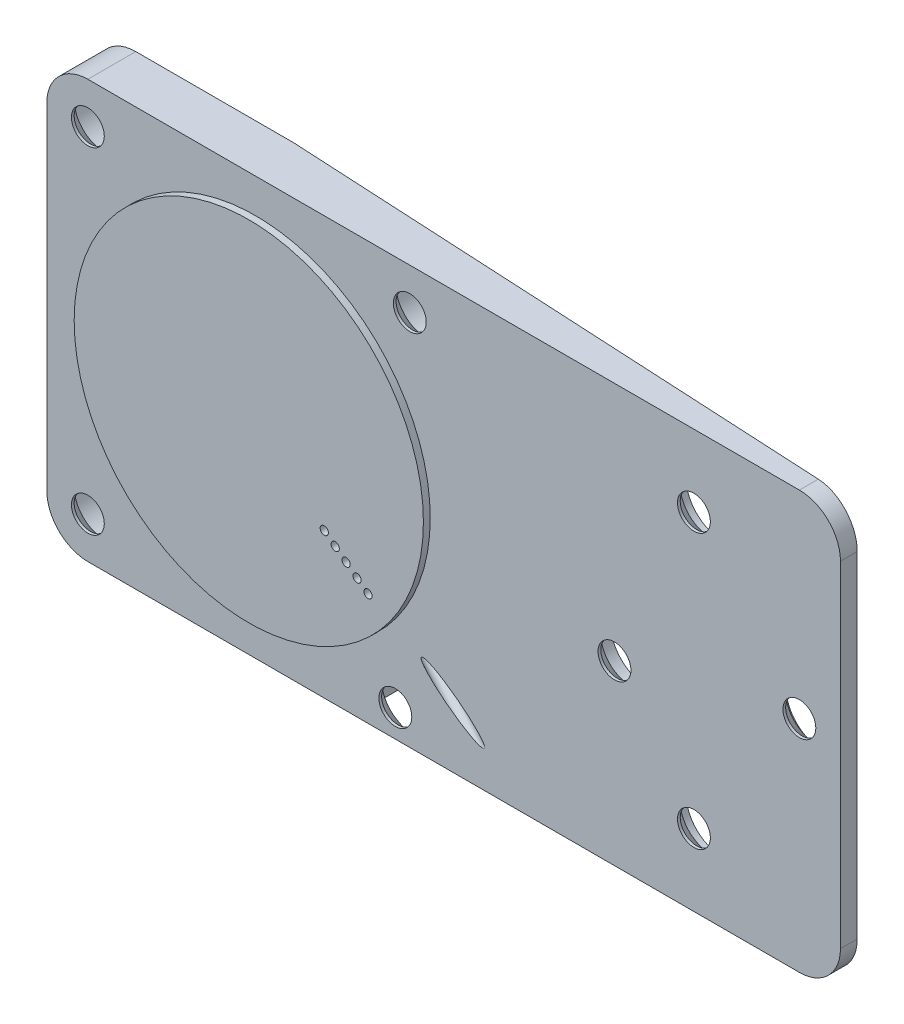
ISO-10303-21;
HEADER;
FILE_DESCRIPTION(('STEP AP214'),'2;1');
FILE_NAME('part.step','',(''),(''),'','','');
FILE_SCHEMA(('AUTOMOTIVE_DESIGN { 1 0 10303 214 1 1 1 1 }'));
ENDSEC;
DATA;
#1=APPLICATION_CONTEXT('core data for automotive mechanical design processes');
#2=APPLICATION_PROTOCOL_DEFINITION('international standard','automotive_design',2000,#1);
#3=PRODUCT_CONTEXT('',#1,'mechanical');
#4=PRODUCT('Part','Part','',(#3));
#5=PRODUCT_RELATED_PRODUCT_CATEGORY('part','',(#4));
#6=PRODUCT_DEFINITION_FORMATION('','',#4);
#7=PRODUCT_DEFINITION_CONTEXT('part definition',#1,'design');
#8=PRODUCT_DEFINITION('design','',#6,#7);
#9=PRODUCT_DEFINITION_SHAPE('','',#8);
#10=(LENGTH_UNIT() NAMED_UNIT(*) SI_UNIT(.MILLI.,.METRE.));
#11=(NAMED_UNIT(*) PLANE_ANGLE_UNIT() SI_UNIT($,.RADIAN.));
#12=(NAMED_UNIT(*) SI_UNIT($,.STERADIAN.) SOLID_ANGLE_UNIT());
#13=UNCERTAINTY_MEASURE_WITH_UNIT(LENGTH_MEASURE(1.E-05),#10,'distance_accuracy_value','');
#14=(GEOMETRIC_REPRESENTATION_CONTEXT(3) GLOBAL_UNCERTAINTY_ASSIGNED_CONTEXT((#13)) GLOBAL_UNIT_ASSIGNED_CONTEXT((#10,
#11,#12)) REPRESENTATION_CONTEXT('',''));
#15=CARTESIAN_POINT('',(0.,0.,0.));
#16=DIRECTION('',(0.,0.,1.));
#17=DIRECTION('',(1.,0.,0.));
#18=AXIS2_PLACEMENT_3D('',#15,#16,#17);
#19=CARTESIAN_POINT('',(19.5809830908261,-59.7,-6.));
#20=DIRECTION('',(0.0523359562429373,0.,-0.998629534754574));
#21=DIRECTION('',(-0.998629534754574,0.,-0.0523359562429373));
#22=AXIS2_PLACEMENT_3D('',#19,#20,#21);
#23=PLANE('',#22);
#24=CARTESIAN_POINT('',(31.5555555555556,-64.75,-5.37243924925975));
#25=DIRECTION('',(0.0523359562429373,0.,-0.998629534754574));
#26=DIRECTION('',(-0.998629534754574,0.,-0.0523359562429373));
#27=AXIS2_PLACEMENT_3D('',#24,#25,#26);
#28=ELLIPSE('',#27,2.5034308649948,2.5);
#29=CARTESIAN_POINT('',(29.0555555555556,-64.75,-5.50345869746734));
#30=VERTEX_POINT('',#29);
#31=EDGE_CURVE('E220',#30,#30,#28,.T.);
#32=ORIENTED_EDGE('',*,*,#31,.F.);
#33=EDGE_LOOP('',(#32));
#34=FACE_BOUND('',#33,.T.);
#35=CARTESIAN_POINT('',(52.3,-67.,-4.28526898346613));
#36=DIRECTION('',(0.0523359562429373,0.,-0.998629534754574));
#37=DIRECTION('',(-0.998629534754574,0.,-0.0523359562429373));
#38=AXIS2_PLACEMENT_3D('',#35,#36,#37);
#39=ELLIPSE('',#38,2.5034308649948,2.5);
#40=CARTESIAN_POINT('',(49.8,-67.,-4.41628843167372));
#41=VERTEX_POINT('',#40);
#42=EDGE_CURVE('E231',#41,#41,#39,.T.);
#43=ORIENTED_EDGE('',*,*,#42,.F.);
#44=EDGE_LOOP('',(#43));
#45=FACE_BOUND('',#44,.T.);
#46=CARTESIAN_POINT('',(46.5,-79.3,-4.58923410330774));
#47=DIRECTION('',(0.0523359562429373,0.,-0.998629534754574));
#48=DIRECTION('',(-0.998629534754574,0.,-0.0523359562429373));
#49=AXIS2_PLACEMENT_3D('',#46,#47,#48);
#50=ELLIPSE('',#49,2.5034308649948,2.5);
#51=CARTESIAN_POINT('',(44.,-79.3,-4.72025355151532));
#52=VERTEX_POINT('',#51);
#53=EDGE_CURVE('E242',#52,#52,#50,.T.);
#54=ORIENTED_EDGE('',*,*,#53,.F.);
#55=EDGE_LOOP('',(#54));
#56=FACE_BOUND('',#55,.T.);
#57=CARTESIAN_POINT('',(52.3,-87.,-4.28526898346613));
#58=DIRECTION('',(0.0523359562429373,0.,-0.998629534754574));
#59=DIRECTION('',(-0.998629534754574,0.,-0.0523359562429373));
#60=AXIS2_PLACEMENT_3D('',#57,#58,#59);
#61=ELLIPSE('',#60,2.5034308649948,2.5);
#62=CARTESIAN_POINT('',(49.8,-87.,-4.41628843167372));
#63=VERTEX_POINT('',#62);
#64=EDGE_CURVE('E253',#63,#63,#61,.T.);
#65=ORIENTED_EDGE('',*,*,#64,.F.);
#66=EDGE_LOOP('',(#65));
#67=FACE_BOUND('',#66,.T.);
#68=CARTESIAN_POINT('',(60.,-76.2,-3.88172908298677));
#69=DIRECTION('',(0.0523359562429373,0.,-0.998629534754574));
#70=DIRECTION('',(-0.998629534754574,0.,-0.0523359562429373));
#71=AXIS2_PLACEMENT_3D('',#68,#69,#70);
#72=ELLIPSE('',#71,2.5034308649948,2.5);
#73=CARTESIAN_POINT('',(57.5,-76.2,-4.01274853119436));
#74=VERTEX_POINT('',#73);
#75=EDGE_CURVE('E961',#74,#74,#72,.T.);
#76=ORIENTED_EDGE('',*,*,#75,.F.);
#77=EDGE_LOOP('',(#76));
#78=FACE_BOUND('',#77,.T.);
#79=DIRECTION('',(0.,-1.,0.));
#80=VECTOR('',#79,1.);
#81=CARTESIAN_POINT('',(28.,-59.7,-5.55877802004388));
#82=LINE('',#81,#80);
#83=CARTESIAN_POINT('',(28.,-90.25,-5.55877802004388));
#84=VERTEX_POINT('',#83);
#85=CARTESIAN_POINT('',(28.,-91.75,-5.55877802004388));
#86=VERTEX_POINT('',#85);
#87=EDGE_CURVE('E438',#84,#86,#82,.T.);
#88=ORIENTED_EDGE('',*,*,#87,.T.);
#89=DIRECTION('',(0.706621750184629,0.706621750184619,0.0370324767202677));
#90=VECTOR('',#89,1.);
#91=CARTESIAN_POINT('',(39.7877418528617,-79.9622581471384,-4.94100864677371));
#92=LINE('',#91,#90);
#93=CARTESIAN_POINT('',(27.5,-92.25,-5.58498190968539));
#94=VERTEX_POINT('',#93);
#95=EDGE_CURVE('E425',#86,#94,#92,.F.);
#96=ORIENTED_EDGE('',*,*,#95,.T.);
#97=DIRECTION('',(0.998629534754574,0.,0.0523359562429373));
#98=VECTOR('',#97,1.);
#99=CARTESIAN_POINT('',(8.04178284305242,-92.25,-6.60474385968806));
#100=LINE('',#99,#98);
#101=CARTESIAN_POINT('',(19.5809830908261,-92.25,-6.));
#102=VERTEX_POINT('',#101);
#103=EDGE_CURVE('E914',#102,#94,#100,.T.);
#104=ORIENTED_EDGE('',*,*,#103,.F.);
#105=DIRECTION('',(0.,-1.,0.));
#106=VECTOR('',#105,1.);
#107=CARTESIAN_POINT('',(19.5809830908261,-59.7,-6.));
#108=LINE('',#107,#106);
#109=CARTESIAN_POINT('',(19.5809830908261,-61.75,-6.));
#110=VERTEX_POINT('',#109);
#111=EDGE_CURVE('E904',#110,#102,#108,.T.);
#112=ORIENTED_EDGE('',*,*,#111,.F.);
#113=DIRECTION('',(-0.998629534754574,0.,-0.0523359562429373));
#114=VECTOR('',#113,1.);
#115=CARTESIAN_POINT('',(8.04178284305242,-61.75,-6.60474385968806));
#116=LINE('',#115,#114);
#117=CARTESIAN_POINT('',(60.,-61.75,-3.88172908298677));
#118=VERTEX_POINT('',#117);
#119=EDGE_CURVE('E911',#118,#110,#116,.T.);
#120=ORIENTED_EDGE('',*,*,#119,.F.);
#121=CARTESIAN_POINT('',(60.,-64.75,-3.88172908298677));
#122=DIRECTION('',(0.0523359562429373,0.,-0.998629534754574));
#123=DIRECTION('',(0.998629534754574,0.,0.0523359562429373));
#124=AXIS2_PLACEMENT_3D('',#121,#122,#123);
#125=ELLIPSE('',#124,3.00411703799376,3.);
#126=CARTESIAN_POINT('',(63.,-64.75,-3.72450574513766));
#127=VERTEX_POINT('',#126);
#128=EDGE_CURVE('E922',#127,#118,#125,.F.);
#129=ORIENTED_EDGE('',*,*,#128,.F.);
#130=DIRECTION('',(0.,1.,0.));
#131=VECTOR('',#130,1.);
#132=CARTESIAN_POINT('',(63.,-89.25,-3.72450574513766));
#133=LINE('',#132,#131);
#134=CARTESIAN_POINT('',(63.,-89.25,-3.72450574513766));
#135=VERTEX_POINT('',#134);
#136=EDGE_CURVE('E929',#135,#127,#133,.T.);
#137=ORIENTED_EDGE('',*,*,#136,.F.);
#138=CARTESIAN_POINT('',(60.,-89.25,-3.88172908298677));
#139=DIRECTION('',(0.0523359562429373,0.,-0.998629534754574));
#140=DIRECTION('',(0.998629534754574,0.,0.0523359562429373));
#141=AXIS2_PLACEMENT_3D('',#138,#139,#140);
#142=ELLIPSE('',#141,3.00411703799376,3.);
#143=CARTESIAN_POINT('',(60.,-92.25,-3.88172908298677));
#144=VERTEX_POINT('',#143);
#145=EDGE_CURVE('E933',#144,#135,#142,.F.);
#146=ORIENTED_EDGE('',*,*,#145,.F.);
#147=CARTESIAN_POINT('',(33.5,-92.25,-5.27053523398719));
#148=VERTEX_POINT('',#147);
#149=EDGE_CURVE('E938',#148,#144,#100,.T.);
#150=ORIENTED_EDGE('',*,*,#149,.F.);
#151=DIRECTION('',(0.706621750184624,-0.706621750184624,0.0370324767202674));
#152=VECTOR('',#151,1.);
#153=CARTESIAN_POINT('',(10.2782668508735,-69.0282668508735,-6.48753469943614));
#154=LINE('',#153,#152);
#155=CARTESIAN_POINT('',(33.,-91.75,-5.2967391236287));
#156=VERTEX_POINT('',#155);
#157=EDGE_CURVE('E68',#148,#156,#154,.F.);
#158=ORIENTED_EDGE('',*,*,#157,.T.);
#159=DIRECTION('',(0.,1.,0.));
#160=VECTOR('',#159,1.);
#161=CARTESIAN_POINT('',(33.,-59.7,-5.2967391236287));
#162=LINE('',#161,#160);
#163=CARTESIAN_POINT('',(33.,-90.25,-5.2967391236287));
#164=VERTEX_POINT('',#163);
#165=EDGE_CURVE('E440',#156,#164,#162,.T.);
#166=ORIENTED_EDGE('',*,*,#165,.T.);
#167=CARTESIAN_POINT('',(30.5,-90.25,-5.42775857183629));
#168=DIRECTION('',(0.0523359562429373,0.,-0.998629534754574));
#169=DIRECTION('',(-0.998629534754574,0.,-0.0523359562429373));
#170=AXIS2_PLACEMENT_3D('',#167,#168,#169);
#171=ELLIPSE('',#170,2.5034308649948,2.5);
#172=EDGE_CURVE('E183',#84,#164,#171,.T.);
#173=ORIENTED_EDGE('',*,*,#172,.F.);
#174=EDGE_LOOP('',(#88,#96,#104,#112,#120,#129,#137,#146,#150,#158,#166,#173));
#175=FACE_BOUND('',#174,.T.);
#176=ADVANCED_FACE('F47',(#34,#45,#56,#67,#78,#175),#23,.T.);
#177=CARTESIAN_POINT('',(8.05,-92.25,-6.76153655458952));
#178=DIRECTION('',(0.,-1.,0.));
#179=DIRECTION('',(0.,0.,-1.));
#180=AXIS2_PLACEMENT_3D('',#177,#178,#179);
#181=PLANE('',#180);
#182=ORIENTED_EDGE('',*,*,#103,.T.);
#183=DIRECTION('',(0.,0.,1.));
#184=VECTOR('',#183,1.);
#185=CARTESIAN_POINT('',(27.5,-92.25,-6.76153655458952));
#186=LINE('',#185,#184);
#187=CARTESIAN_POINT('',(27.5,-92.25,-3.69999999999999));
#188=VERTEX_POINT('',#187);
#189=EDGE_CURVE('E429',#94,#188,#186,.T.);
#190=ORIENTED_EDGE('',*,*,#189,.T.);
#191=DIRECTION('',(-1.,0.,0.));
#192=VECTOR('',#191,1.);
#193=CARTESIAN_POINT('',(8.05,-92.25,-3.69999999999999));
#194=LINE('',#193,#192);
#195=CARTESIAN_POINT('',(29.5834848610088,-92.25,-3.69999999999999));
#196=VERTEX_POINT('',#195);
#197=EDGE_CURVE('E385',#196,#188,#194,.T.);
#198=ORIENTED_EDGE('',*,*,#197,.F.);
#199=CARTESIAN_POINT('',(22.8647629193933,-92.25,-9.39283505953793));
#200=CARTESIAN_POINT('',(23.0648315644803,-92.25,-9.19931388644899));
#201=CARTESIAN_POINT('',(23.2651278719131,-92.25,-9.00602691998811));
#202=CARTESIAN_POINT('',(23.6663559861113,-92.25,-8.62008488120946));
#203=CARTESIAN_POINT('',(23.8672878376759,-92.25,-8.42742985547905));
#204=CARTESIAN_POINT('',(24.2705879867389,-92.25,-8.04232286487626));
#205=CARTESIAN_POINT('',(24.4729588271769,-92.25,-7.8498735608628));
#206=CARTESIAN_POINT('',(24.8787358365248,-92.25,-7.46609238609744));
#207=CARTESIAN_POINT('',(25.0821419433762,-92.25,-7.27476044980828));
#208=CARTESIAN_POINT('',(25.5159709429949,-92.25,-6.86970756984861));
#209=CARTESIAN_POINT('',(25.7465825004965,-92.25,-6.65618845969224));
#210=CARTESIAN_POINT('',(26.2104569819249,-92.25,-6.23194255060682));
#211=CARTESIAN_POINT('',(26.4437204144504,-92.25,-6.0212163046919));
#212=CARTESIAN_POINT('',(26.7964358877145,-92.25,-5.70873721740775));
#213=CARTESIAN_POINT('',(26.9143691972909,-92.25,-5.6052717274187));
#214=CARTESIAN_POINT('',(27.1515297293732,-92.25,-5.39983649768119));
#215=CARTESIAN_POINT('',(27.2707569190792,-92.25,-5.29786672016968));
#216=CARTESIAN_POINT('',(27.5108463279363,-92.25,-5.09594543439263));
#217=CARTESIAN_POINT('',(27.6317080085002,-92.25,-4.99599328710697));
#218=CARTESIAN_POINT('',(27.8756267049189,-92.25,-4.7988114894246));
#219=CARTESIAN_POINT('',(27.9986834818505,-92.25,-4.70158154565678));
#220=CARTESIAN_POINT('',(28.1864866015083,-92.25,-4.55789139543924));
#221=CARTESIAN_POINT('',(28.2501305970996,-92.25,-4.50999082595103));
#222=CARTESIAN_POINT('',(28.3783258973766,-92.25,-4.41541149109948));
#223=CARTESIAN_POINT('',(28.4428772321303,-92.25,-4.36873276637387));
#224=CARTESIAN_POINT('',(28.5731304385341,-92.25,-4.27681369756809));
#225=CARTESIAN_POINT('',(28.6388337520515,-92.25,-4.23157539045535));
#226=CARTESIAN_POINT('',(28.7714932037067,-92.25,-4.14297134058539));
#227=CARTESIAN_POINT('',(28.8384492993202,-92.25,-4.09960553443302));
#228=CARTESIAN_POINT('',(28.9727819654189,-92.25,-4.01588519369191));
#229=CARTESIAN_POINT('',(29.0401357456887,-92.25,-3.97549427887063));
#230=CARTESIAN_POINT('',(29.1765214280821,-92.25,-3.89759481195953));
#231=CARTESIAN_POINT('',(29.245553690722,-92.25,-3.86008688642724));
#232=CARTESIAN_POINT('',(29.385358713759,-92.25,-3.7888458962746));
#233=CARTESIAN_POINT('',(29.4561271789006,-92.25,-3.75510447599));
#234=CARTESIAN_POINT('',(29.5997189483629,-92.25,-3.69233684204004));
#235=CARTESIAN_POINT('',(29.6725413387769,-92.25,-3.66330856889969));
#236=CARTESIAN_POINT('',(29.80858924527,-92.25,-3.61534108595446));
#237=CARTESIAN_POINT('',(29.8715054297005,-92.25,-3.59553195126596));
#238=CARTESIAN_POINT('',(29.9987256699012,-92.25,-3.56095427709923));
#239=CARTESIAN_POINT('',(30.0630296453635,-92.25,-3.54618544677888));
#240=CARTESIAN_POINT('',(30.1923283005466,-92.25,-3.52253567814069));
#241=CARTESIAN_POINT('',(30.2573164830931,-92.25,-3.51361979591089));
#242=CARTESIAN_POINT('',(30.3878542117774,-92.25,-3.50208734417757));
#243=CARTESIAN_POINT('',(30.4534037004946,-92.25,-3.49947013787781));
#244=CARTESIAN_POINT('',(30.5825852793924,-92.25,-3.50069134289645));
#245=CARTESIAN_POINT('',(30.6462191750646,-92.25,-3.50434930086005));
#246=CARTESIAN_POINT('',(30.7728673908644,-92.25,-3.51754497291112));
#247=CARTESIAN_POINT('',(30.8358816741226,-92.25,-3.52708303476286));
#248=CARTESIAN_POINT('',(30.9612196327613,-92.25,-3.55156506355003));
#249=CARTESIAN_POINT('',(31.0235370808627,-92.25,-3.56654044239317));
#250=CARTESIAN_POINT('',(31.1468433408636,-92.25,-3.60116760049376));
#251=CARTESIAN_POINT('',(31.2078320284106,-92.25,-3.62081981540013));
#252=CARTESIAN_POINT('',(31.4024312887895,-92.25,-3.69057532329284));
#253=CARTESIAN_POINT('',(31.5332548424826,-92.25,-3.74843806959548));
#254=CARTESIAN_POINT('',(31.7886662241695,-92.25,-3.87663676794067));
#255=CARTESIAN_POINT('',(31.9132407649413,-92.25,-3.94699796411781));
#256=CARTESIAN_POINT('',(32.0972115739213,-92.25,-4.05904539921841));
#257=CARTESIAN_POINT('',(32.1584518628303,-92.25,-4.09775930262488));
#258=CARTESIAN_POINT('',(32.2798329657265,-92.25,-4.17687836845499));
#259=CARTESIAN_POINT('',(32.3399737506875,-92.25,-4.21728357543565));
#260=CARTESIAN_POINT('',(32.4592448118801,-92.25,-4.29942392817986));
#261=CARTESIAN_POINT('',(32.5183760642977,-92.25,-4.34115766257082));
#262=CARTESIAN_POINT('',(32.6358165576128,-92.25,-4.42575800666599));
#263=CARTESIAN_POINT('',(32.6941258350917,-92.25,-4.46862456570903));
#264=CARTESIAN_POINT('',(32.9039945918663,-92.25,-4.62553140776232));
#265=CARTESIAN_POINT('',(33.0535049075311,-92.25,-4.74231210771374));
#266=CARTESIAN_POINT('',(33.3492211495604,-92.25,-4.97999767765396));
#267=CARTESIAN_POINT('',(33.4954263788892,-92.25,-5.10090340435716));
#268=CARTESIAN_POINT('',(33.7855350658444,-92.25,-5.34560427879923));
#269=CARTESIAN_POINT('',(33.9294371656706,-92.25,-5.46940103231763));
#270=CARTESIAN_POINT('',(34.2154893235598,-92.25,-5.71900385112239));
#271=CARTESIAN_POINT('',(34.3576393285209,-92.25,-5.84480997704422));
#272=CARTESIAN_POINT('',(34.6409640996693,-92.25,-6.09821282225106));
#273=CARTESIAN_POINT('',(34.7821355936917,-92.25,-6.22581319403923));
#274=CARTESIAN_POINT('',(35.0634524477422,-92.25,-6.48214373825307));
#275=CARTESIAN_POINT('',(35.2035977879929,-92.25,-6.61087393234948));
#276=CARTESIAN_POINT('',(35.622733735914,-92.25,-6.9982663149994));
#277=CARTESIAN_POINT('',(35.9005271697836,-92.25,-7.25822307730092));
#278=CARTESIAN_POINT('',(36.4175721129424,-92.25,-7.74590936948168));
#279=CARTESIAN_POINT('',(36.6570776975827,-92.25,-7.97337053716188));
#280=CARTESIAN_POINT('',(37.1349864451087,-92.25,-8.42949874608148));
#281=CARTESIAN_POINT('',(37.3733894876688,-92.25,-8.65816591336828));
#282=CARTESIAN_POINT('',(37.8483417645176,-92.25,-9.1153793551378));
#283=CARTESIAN_POINT('',(38.0848945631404,-92.25,-9.34392193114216));
#284=CARTESIAN_POINT('',(38.5573311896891,-92.25,-9.80164174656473));
#285=CARTESIAN_POINT('',(38.7932150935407,-92.25,-10.0308189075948));
#286=CARTESIAN_POINT('',(39.0288703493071,-92.25,-10.2602299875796));
#287=B_SPLINE_CURVE_WITH_KNOTS('',3,(#199,#200,#201,#202,#203,#204,#205,#206,#207,#208,#209,
#210,#211,#212,#213,#214,#215,#216,#217,#218,#219,#220,#221,#222,#223,#224,#225,#226,#227,#228,
#229,#230,#231,#232,#233,#234,#235,#236,#237,#238,#239,#240,#241,#242,#243,#244,#245,#246,#247,
#248,#249,#250,#251,#252,#253,#254,#255,#256,#257,#258,#259,#260,#261,#262,#263,#264,#265,#266,
#267,#268,#269,#270,#271,#272,#273,#274,#275,#276,#277,#278,#279,#280,#281,#282,#283,#284,#285,
#286),.UNSPECIFIED.,.F.,.F.,(4,2,2,2,2,2,2,2,2,2,2,2,2,2,2,2,2,2,2,2,2,2,2,2,2,2,2,2,2,2,2,2,2,
2,2,2,2,2,2,2,2,2,2,4),(0.,0.835046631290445,1.67015349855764,2.50795488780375,3.34570663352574,
4.28853501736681,5.23154738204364,5.70219798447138,6.17283668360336,6.64332390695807,
7.11376022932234,7.35271591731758,7.59167954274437,7.83096730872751,8.07024696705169,
8.3057999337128,8.54140394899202,8.77647445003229,9.01144195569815,9.20915015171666,
9.40684693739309,9.6033524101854,9.79983801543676,9.99076758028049,10.1817084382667,
10.3737704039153,10.5658502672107,10.9937960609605,11.4226162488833,11.6399451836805,
11.8572798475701,12.0743908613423,12.2914921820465,12.8604963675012,13.4296194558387,
13.9990665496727,14.5685308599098,15.1394004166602,15.7102809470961,16.8516264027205,
17.8425381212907,18.8335555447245,19.8203168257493,20.8069612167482),.UNSPECIFIED.);
#288=CARTESIAN_POINT('',(31.4165151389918,-92.25,-3.69999999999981));
#289=VERTEX_POINT('',#288);
#290=EDGE_CURVE('E377',#289,#196,#287,.F.);
#291=ORIENTED_EDGE('',*,*,#290,.F.);
#292=CARTESIAN_POINT('',(33.5,-92.25,-3.69999999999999));
#293=VERTEX_POINT('',#292);
#294=EDGE_CURVE('E1063',#293,#289,#194,.T.);
#295=ORIENTED_EDGE('',*,*,#294,.F.);
#296=DIRECTION('',(0.,0.,-1.));
#297=VECTOR('',#296,1.);
#298=CARTESIAN_POINT('',(33.5,-92.25,-6.76153655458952));
#299=LINE('',#298,#297);
#300=EDGE_CURVE('E184',#293,#148,#299,.T.);
#301=ORIENTED_EDGE('',*,*,#300,.T.);
#302=ORIENTED_EDGE('',*,*,#149,.T.);
#303=DIRECTION('',(0.,0.,1.));
#304=VECTOR('',#303,1.);
#305=CARTESIAN_POINT('',(60.,-92.25,-6.76153655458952));
#306=LINE('',#305,#304);
#307=CARTESIAN_POINT('',(60.,-92.25,-2.5));
#308=VERTEX_POINT('',#307);
#309=EDGE_CURVE('E936',#144,#308,#306,.T.);
#310=ORIENTED_EDGE('',*,*,#309,.T.);
#311=DIRECTION('',(1.,0.,0.));
#312=VECTOR('',#311,1.);
#313=CARTESIAN_POINT('',(8.05,-92.25,-2.5));
#314=LINE('',#313,#312);
#315=CARTESIAN_POINT('',(8.05,-92.25,-2.5));
#316=VERTEX_POINT('',#315);
#317=EDGE_CURVE('E1046',#316,#308,#314,.T.);
#318=ORIENTED_EDGE('',*,*,#317,.F.);
#319=DIRECTION('',(0.,0.,1.));
#320=VECTOR('',#319,1.);
#321=CARTESIAN_POINT('',(8.05,-92.25,-6.76153655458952));
#322=LINE('',#321,#320);
#323=CARTESIAN_POINT('',(8.05,-92.25,-6.00000000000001));
#324=VERTEX_POINT('',#323);
#325=EDGE_CURVE('E941',#324,#316,#322,.T.);
#326=ORIENTED_EDGE('',*,*,#325,.F.);
#327=DIRECTION('',(1.,0.,0.));
#328=VECTOR('',#327,1.);
#329=CARTESIAN_POINT('',(8.05,-92.25,-6.00000000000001));
#330=LINE('',#329,#328);
#331=EDGE_CURVE('E939',#324,#102,#330,.T.);
#332=ORIENTED_EDGE('',*,*,#331,.T.);
#333=EDGE_LOOP('',(#182,#190,#198,#291,#295,#301,#302,#310,#318,#326,#332));
#334=FACE_BOUND('',#333,.T.);
#335=ADVANCED_FACE('F389',(#334),#181,.T.);
#336=CARTESIAN_POINT('',(30.5,-90.25,-5.99999999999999));
#337=DIRECTION('',(0.,0.,-1.));
#338=DIRECTION('',(-1.,0.,0.));
#339=AXIS2_PLACEMENT_3D('',#336,#337,#338);
#340=CYLINDRICAL_SURFACE('',#339,2.5);
#341=ORIENTED_EDGE('',*,*,#172,.T.);
#342=DIRECTION('',(0.,0.,-1.));
#343=VECTOR('',#342,1.);
#344=CARTESIAN_POINT('',(33.,-90.25,-5.99999999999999));
#345=LINE('',#344,#343);
#346=CARTESIAN_POINT('',(33.,-90.25,-3.69999999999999));
#347=VERTEX_POINT('',#346);
#348=EDGE_CURVE('E170',#164,#347,#345,.F.);
#349=ORIENTED_EDGE('',*,*,#348,.T.);
#350=CARTESIAN_POINT('',(30.5,-90.25,-3.69999999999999));
#351=DIRECTION('',(0.,0.,-1.));
#352=DIRECTION('',(-1.,0.,0.));
#353=AXIS2_PLACEMENT_3D('',#350,#351,#352);
#354=CIRCLE('',#353,2.5);
#355=CARTESIAN_POINT('',(28.,-90.25,-3.69999999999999));
#356=VERTEX_POINT('',#355);
#357=EDGE_CURVE('E181',#356,#347,#354,.T.);
#358=ORIENTED_EDGE('',*,*,#357,.F.);
#359=DIRECTION('',(0.,0.,-1.));
#360=VECTOR('',#359,1.);
#361=CARTESIAN_POINT('',(28.,-90.25,-5.99999999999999));
#362=LINE('',#361,#360);
#363=EDGE_CURVE('E185',#84,#356,#362,.F.);
#364=ORIENTED_EDGE('',*,*,#363,.F.);
#365=EDGE_LOOP('',(#341,#349,#358,#364));
#366=FACE_BOUND('',#365,.T.);
#367=ADVANCED_FACE('F179',(#366),#340,.F.);
#368=CARTESIAN_POINT('',(0.,-59.7,-6.00000000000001));
#369=DIRECTION('',(0.,0.,-1.));
#370=DIRECTION('',(-1.,0.,0.));
#371=AXIS2_PLACEMENT_3D('',#368,#369,#370);
#372=PLANE('',#371);
#373=CARTESIAN_POINT('',(8.05000000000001,-64.75,-6.00000000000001));
#374=DIRECTION('',(0.,0.,-1.));
#375=DIRECTION('',(-1.,0.,0.));
#376=AXIS2_PLACEMENT_3D('',#373,#374,#375);
#377=CIRCLE('',#376,2.5);
#378=CARTESIAN_POINT('',(5.55000000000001,-64.75,-6.00000000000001));
#379=VERTEX_POINT('',#378);
#380=EDGE_CURVE('E444',#379,#379,#377,.T.);
#381=ORIENTED_EDGE('',*,*,#380,.F.);
#382=EDGE_LOOP('',(#381));
#383=FACE_BOUND('',#382,.T.);
#384=CARTESIAN_POINT('',(8.05000000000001,-89.25,-6.00000000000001));
#385=DIRECTION('',(0.,0.,-1.));
#386=DIRECTION('',(-1.,0.,0.));
#387=AXIS2_PLACEMENT_3D('',#384,#385,#386);
#388=CIRCLE('',#387,2.5);
#389=CARTESIAN_POINT('',(5.55000000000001,-89.25,-6.00000000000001));
#390=VERTEX_POINT('',#389);
#391=EDGE_CURVE('E457',#390,#390,#388,.T.);
#392=ORIENTED_EDGE('',*,*,#391,.F.);
#393=EDGE_LOOP('',(#392));
#394=FACE_BOUND('',#393,.T.);
#395=DIRECTION('',(-1.,0.,0.));
#396=VECTOR('',#395,1.);
#397=CARTESIAN_POINT('',(8.05,-61.75,-6.00000000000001));
#398=LINE('',#397,#396);
#399=CARTESIAN_POINT('',(8.05,-61.75,-6.00000000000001));
#400=VERTEX_POINT('',#399);
#401=EDGE_CURVE('E902',#110,#400,#398,.T.);
#402=ORIENTED_EDGE('',*,*,#401,.F.);
#403=ORIENTED_EDGE('',*,*,#111,.T.);
#404=ORIENTED_EDGE('',*,*,#331,.F.);
#405=CARTESIAN_POINT('',(8.05,-89.25,-6.00000000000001));
#406=DIRECTION('',(0.,0.,-1.));
#407=DIRECTION('',(-1.,0.,0.));
#408=AXIS2_PLACEMENT_3D('',#405,#406,#407);
#409=CIRCLE('',#408,3.);
#410=CARTESIAN_POINT('',(5.05,-89.25,-6.00000000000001));
#411=VERTEX_POINT('',#410);
#412=EDGE_CURVE('E942',#411,#324,#409,.F.);
#413=ORIENTED_EDGE('',*,*,#412,.F.);
#414=DIRECTION('',(0.,-1.,0.));
#415=VECTOR('',#414,1.);
#416=CARTESIAN_POINT('',(5.05,-89.25,-6.00000000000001));
#417=LINE('',#416,#415);
#418=CARTESIAN_POINT('',(5.05,-64.75,-6.00000000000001));
#419=VERTEX_POINT('',#418);
#420=EDGE_CURVE('E952',#419,#411,#417,.T.);
#421=ORIENTED_EDGE('',*,*,#420,.F.);
#422=CARTESIAN_POINT('',(8.05,-64.75,-6.00000000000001));
#423=DIRECTION('',(0.,0.,-1.));
#424=DIRECTION('',(-1.,0.,0.));
#425=AXIS2_PLACEMENT_3D('',#422,#423,#424);
#426=CIRCLE('',#425,3.);
#427=EDGE_CURVE('E907',#400,#419,#426,.F.);
#428=ORIENTED_EDGE('',*,*,#427,.F.);
#429=EDGE_LOOP('',(#402,#403,#404,#413,#421,#428));
#430=FACE_BOUND('',#429,.T.);
#431=ADVANCED_FACE('F409',(#383,#394,#430),#372,.T.);
#432=CARTESIAN_POINT('',(8.05,-64.75,-2.5));
#433=DIRECTION('',(0.,0.,1.));
#434=DIRECTION('',(1.,0.,0.));
#435=AXIS2_PLACEMENT_3D('',#432,#433,#434);
#436=PLANE('',#435);
#437=CARTESIAN_POINT('',(8.05000000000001,-64.75,-2.5));
#438=DIRECTION('',(0.,0.,1.));
#439=DIRECTION('',(1.,0.,0.));
#440=AXIS2_PLACEMENT_3D('',#437,#438,#439);
#441=CIRCLE('',#440,1.2);
#442=CARTESIAN_POINT('',(9.25000000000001,-64.75,-2.5));
#443=VERTEX_POINT('',#442);
#444=EDGE_CURVE('E456',#443,#443,#441,.T.);
#445=ORIENTED_EDGE('',*,*,#444,.F.);
#446=EDGE_LOOP('',(#445));
#447=FACE_BOUND('',#446,.T.);
#448=CARTESIAN_POINT('',(8.05000000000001,-89.25,-2.5));
#449=DIRECTION('',(0.,0.,1.));
#450=DIRECTION('',(1.,0.,0.));
#451=AXIS2_PLACEMENT_3D('',#448,#449,#450);
#452=CIRCLE('',#451,1.2);
#453=CARTESIAN_POINT('',(9.25000000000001,-89.25,-2.5));
#454=VERTEX_POINT('',#453);
#455=EDGE_CURVE('E192',#454,#454,#452,.T.);
#456=ORIENTED_EDGE('',*,*,#455,.F.);
#457=EDGE_LOOP('',(#456));
#458=FACE_BOUND('',#457,.T.);
#459=CARTESIAN_POINT('',(30.5,-90.25,-2.5));
#460=DIRECTION('',(0.,0.,1.));
#461=DIRECTION('',(1.,0.,0.));
#462=AXIS2_PLACEMENT_3D('',#459,#460,#461);
#463=CIRCLE('',#462,1.2);
#464=CARTESIAN_POINT('',(31.7,-90.25,-2.5));
#465=VERTEX_POINT('',#464);
#466=EDGE_CURVE('E204',#465,#465,#463,.T.);
#467=ORIENTED_EDGE('',*,*,#466,.F.);
#468=EDGE_LOOP('',(#467));
#469=FACE_BOUND('',#468,.T.);
#470=CARTESIAN_POINT('',(31.5555555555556,-64.75,-2.5));
#471=DIRECTION('',(0.,0.,1.));
#472=DIRECTION('',(1.,0.,0.));
#473=AXIS2_PLACEMENT_3D('',#470,#471,#472);
#474=CIRCLE('',#473,1.2);
#475=CARTESIAN_POINT('',(32.7555555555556,-64.75,-2.5));
#476=VERTEX_POINT('',#475);
#477=EDGE_CURVE('E215',#476,#476,#474,.T.);
#478=ORIENTED_EDGE('',*,*,#477,.F.);
#479=EDGE_LOOP('',(#478));
#480=FACE_BOUND('',#479,.T.);
#481=CARTESIAN_POINT('',(52.3,-67.,-2.5));
#482=DIRECTION('',(0.,0.,1.));
#483=DIRECTION('',(1.,0.,0.));
#484=AXIS2_PLACEMENT_3D('',#481,#482,#483);
#485=CIRCLE('',#484,1.2);
#486=CARTESIAN_POINT('',(53.5,-67.,-2.5));
#487=VERTEX_POINT('',#486);
#488=EDGE_CURVE('E226',#487,#487,#485,.T.);
#489=ORIENTED_EDGE('',*,*,#488,.F.);
#490=EDGE_LOOP('',(#489));
#491=FACE_BOUND('',#490,.T.);
#492=CARTESIAN_POINT('',(46.5,-79.3,-2.5));
#493=DIRECTION('',(0.,0.,1.));
#494=DIRECTION('',(1.,0.,0.));
#495=AXIS2_PLACEMENT_3D('',#492,#493,#494);
#496=CIRCLE('',#495,1.2);
#497=CARTESIAN_POINT('',(47.7,-79.3,-2.5));
#498=VERTEX_POINT('',#497);
#499=EDGE_CURVE('E237',#498,#498,#496,.T.);
#500=ORIENTED_EDGE('',*,*,#499,.F.);
#501=EDGE_LOOP('',(#500));
#502=FACE_BOUND('',#501,.T.);
#503=CARTESIAN_POINT('',(52.3,-87.,-2.5));
#504=DIRECTION('',(0.,0.,1.));
#505=DIRECTION('',(1.,0.,0.));
#506=AXIS2_PLACEMENT_3D('',#503,#504,#505);
#507=CIRCLE('',#506,1.2);
#508=CARTESIAN_POINT('',(53.5,-87.,-2.5));
#509=VERTEX_POINT('',#508);
#510=EDGE_CURVE('E248',#509,#509,#507,.T.);
#511=ORIENTED_EDGE('',*,*,#510,.F.);
#512=EDGE_LOOP('',(#511));
#513=FACE_BOUND('',#512,.T.);
#514=CARTESIAN_POINT('',(60.,-76.2,-2.5));
#515=DIRECTION('',(0.,0.,1.));
#516=DIRECTION('',(1.,0.,0.));
#517=AXIS2_PLACEMENT_3D('',#514,#515,#516);
#518=CIRCLE('',#517,1.2);
#519=CARTESIAN_POINT('',(61.2,-76.2,-2.5));
#520=VERTEX_POINT('',#519);
#521=EDGE_CURVE('E259',#520,#520,#518,.T.);
#522=ORIENTED_EDGE('',*,*,#521,.F.);
#523=EDGE_LOOP('',(#522));
#524=FACE_BOUND('',#523,.T.);
#525=CARTESIAN_POINT('',(34.6989072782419,-87.8503548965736,-2.5));
#526=DIRECTION('',(0.,0.,1.));
#527=DIRECTION('',(0.798635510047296,-0.601815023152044,0.));
#528=AXIS2_PLACEMENT_3D('',#525,#526,#527);
#529=ELLIPSE('',#528,2.87938524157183,0.500000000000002);
#530=CARTESIAN_POINT('',(36.9984865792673,-89.5832121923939,-2.5));
#531=VERTEX_POINT('',#530);
#532=EDGE_CURVE('E954',#531,#531,#529,.T.);
#533=ORIENTED_EDGE('',*,*,#532,.F.);
#534=EDGE_LOOP('',(#533));
#535=FACE_BOUND('',#534,.T.);
#536=CARTESIAN_POINT('',(20.3,-77.,-2.5));
#537=DIRECTION('',(0.,0.,1.));
#538=DIRECTION('',(1.,0.,0.));
#539=AXIS2_PLACEMENT_3D('',#536,#537,#538);
#540=CIRCLE('',#539,12.75);
#541=CARTESIAN_POINT('',(33.05,-77.,-2.5));
#542=VERTEX_POINT('',#541);
#543=EDGE_CURVE('E957',#542,#542,#540,.F.);
#544=ORIENTED_EDGE('',*,*,#543,.T.);
#545=EDGE_LOOP('',(#544));
#546=FACE_BOUND('',#545,.T.);
#547=CARTESIAN_POINT('',(8.05,-64.75,-2.5));
#548=DIRECTION('',(0.,0.,1.));
#549=DIRECTION('',(1.,0.,0.));
#550=AXIS2_PLACEMENT_3D('',#547,#548,#549);
#551=CIRCLE('',#550,3.);
#552=CARTESIAN_POINT('',(8.05,-61.75,-2.5));
#553=VERTEX_POINT('',#552);
#554=CARTESIAN_POINT('',(5.05,-64.75,-2.5));
#555=VERTEX_POINT('',#554);
#556=EDGE_CURVE('E915',#553,#555,#551,.T.);
#557=ORIENTED_EDGE('',*,*,#556,.T.);
#558=DIRECTION('',(0.,-1.,0.));
#559=VECTOR('',#558,1.);
#560=CARTESIAN_POINT('',(5.05,-89.25,-2.5));
#561=LINE('',#560,#559);
#562=CARTESIAN_POINT('',(5.05,-89.25,-2.5));
#563=VERTEX_POINT('',#562);
#564=EDGE_CURVE('E1025',#555,#563,#561,.T.);
#565=ORIENTED_EDGE('',*,*,#564,.T.);
#566=CARTESIAN_POINT('',(8.05,-89.25,-2.5));
#567=DIRECTION('',(0.,0.,1.));
#568=DIRECTION('',(1.,0.,0.));
#569=AXIS2_PLACEMENT_3D('',#566,#567,#568);
#570=CIRCLE('',#569,3.);
#571=EDGE_CURVE('E1029',#563,#316,#570,.T.);
#572=ORIENTED_EDGE('',*,*,#571,.T.);
#573=ORIENTED_EDGE('',*,*,#317,.T.);
#574=CARTESIAN_POINT('',(60.,-89.25,-2.5));
#575=DIRECTION('',(0.,0.,1.));
#576=DIRECTION('',(1.,0.,0.));
#577=AXIS2_PLACEMENT_3D('',#574,#575,#576);
#578=CIRCLE('',#577,3.);
#579=CARTESIAN_POINT('',(63.,-89.25,-2.5));
#580=VERTEX_POINT('',#579);
#581=EDGE_CURVE('E1043',#308,#580,#578,.T.);
#582=ORIENTED_EDGE('',*,*,#581,.T.);
#583=DIRECTION('',(0.,1.,0.));
#584=VECTOR('',#583,1.);
#585=CARTESIAN_POINT('',(63.,-89.25,-2.5));
#586=LINE('',#585,#584);
#587=CARTESIAN_POINT('',(63.,-64.75,-2.5));
#588=VERTEX_POINT('',#587);
#589=EDGE_CURVE('E1036',#580,#588,#586,.T.);
#590=ORIENTED_EDGE('',*,*,#589,.T.);
#591=CARTESIAN_POINT('',(60.,-64.75,-2.5));
#592=DIRECTION('',(0.,0.,1.));
#593=DIRECTION('',(1.,0.,0.));
#594=AXIS2_PLACEMENT_3D('',#591,#592,#593);
#595=CIRCLE('',#594,3.);
#596=CARTESIAN_POINT('',(60.,-61.75,-2.5));
#597=VERTEX_POINT('',#596);
#598=EDGE_CURVE('E1034',#588,#597,#595,.T.);
#599=ORIENTED_EDGE('',*,*,#598,.T.);
#600=DIRECTION('',(-1.,0.,0.));
#601=VECTOR('',#600,1.);
#602=CARTESIAN_POINT('',(8.05,-61.75,-2.5));
#603=LINE('',#602,#601);
#604=EDGE_CURVE('E1027',#597,#553,#603,.T.);
#605=ORIENTED_EDGE('',*,*,#604,.T.);
#606=EDGE_LOOP('',(#557,#565,#572,#573,#582,#590,#599,#605));
#607=FACE_BOUND('',#606,.T.);
#608=ADVANCED_FACE('F404',(#447,#458,#469,#480,#491,#502,#513,#524,#535,#546,#607),#436,.T.);
#609=CARTESIAN_POINT('',(5.05,-89.25,-6.76153655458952));
#610=DIRECTION('',(-1.,0.,0.));
#611=DIRECTION('',(0.,0.,1.));
#612=AXIS2_PLACEMENT_3D('',#609,#610,#611);
#613=PLANE('',#612);
#614=DIRECTION('',(0.,0.,1.));
#615=VECTOR('',#614,1.);
#616=CARTESIAN_POINT('',(5.05,-64.75,-6.76153655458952));
#617=LINE('',#616,#615);
#618=EDGE_CURVE('E386',#419,#555,#617,.T.);
#619=ORIENTED_EDGE('',*,*,#618,.F.);
#620=ORIENTED_EDGE('',*,*,#420,.T.);
#621=DIRECTION('',(0.,0.,1.));
#622=VECTOR('',#621,1.);
#623=CARTESIAN_POINT('',(5.05,-89.25,-6.76153655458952));
#624=LINE('',#623,#622);
#625=EDGE_CURVE('E945',#411,#563,#624,.T.);
#626=ORIENTED_EDGE('',*,*,#625,.T.);
#627=ORIENTED_EDGE('',*,*,#564,.F.);
#628=EDGE_LOOP('',(#619,#620,#626,#627));
#629=FACE_BOUND('',#628,.T.);
#630=ADVANCED_FACE('F400',(#629),#613,.T.);
#631=CARTESIAN_POINT('',(8.05,-89.25,-6.76153655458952));
#632=DIRECTION('',(0.,0.,1.));
#633=DIRECTION('',(1.,0.,0.));
#634=AXIS2_PLACEMENT_3D('',#631,#632,#633);
#635=CYLINDRICAL_SURFACE('',#634,3.);
#636=ORIENTED_EDGE('',*,*,#625,.F.);
#637=ORIENTED_EDGE('',*,*,#412,.T.);
#638=ORIENTED_EDGE('',*,*,#325,.T.);
#639=ORIENTED_EDGE('',*,*,#571,.F.);
#640=EDGE_LOOP('',(#636,#637,#638,#639));
#641=FACE_BOUND('',#640,.T.);
#642=ADVANCED_FACE('F397',(#641),#635,.T.);
#643=CARTESIAN_POINT('',(60.,-89.25,-6.76153655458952));
#644=DIRECTION('',(0.,0.,1.));
#645=DIRECTION('',(1.,0.,0.));
#646=AXIS2_PLACEMENT_3D('',#643,#644,#645);
#647=CYLINDRICAL_SURFACE('',#646,3.);
#648=ORIENTED_EDGE('',*,*,#309,.F.);
#649=ORIENTED_EDGE('',*,*,#145,.T.);
#650=DIRECTION('',(0.,0.,1.));
#651=VECTOR('',#650,1.);
#652=CARTESIAN_POINT('',(63.,-89.25,-6.76153655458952));
#653=LINE('',#652,#651);
#654=EDGE_CURVE('E932',#135,#580,#653,.T.);
#655=ORIENTED_EDGE('',*,*,#654,.T.);
#656=ORIENTED_EDGE('',*,*,#581,.F.);
#657=EDGE_LOOP('',(#648,#649,#655,#656));
#658=FACE_BOUND('',#657,.T.);
#659=ADVANCED_FACE('F395',(#658),#647,.T.);
#660=CARTESIAN_POINT('',(63.,-89.25,-6.76153655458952));
#661=DIRECTION('',(1.,0.,0.));
#662=DIRECTION('',(0.,0.,-1.));
#663=AXIS2_PLACEMENT_3D('',#660,#661,#662);
#664=PLANE('',#663);
#665=ORIENTED_EDGE('',*,*,#654,.F.);
#666=ORIENTED_EDGE('',*,*,#136,.T.);
#667=DIRECTION('',(0.,0.,1.));
#668=VECTOR('',#667,1.);
#669=CARTESIAN_POINT('',(63.,-64.75,-6.76153655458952));
#670=LINE('',#669,#668);
#671=EDGE_CURVE('E928',#127,#588,#670,.T.);
#672=ORIENTED_EDGE('',*,*,#671,.T.);
#673=ORIENTED_EDGE('',*,*,#589,.F.);
#674=EDGE_LOOP('',(#665,#666,#672,#673));
#675=FACE_BOUND('',#674,.T.);
#676=ADVANCED_FACE('F519',(#675),#664,.T.);
#677=CARTESIAN_POINT('',(60.,-64.75,-6.76153655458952));
#678=DIRECTION('',(0.,0.,1.));
#679=DIRECTION('',(1.,0.,0.));
#680=AXIS2_PLACEMENT_3D('',#677,#678,#679);
#681=CYLINDRICAL_SURFACE('',#680,3.);
#682=ORIENTED_EDGE('',*,*,#671,.F.);
#683=ORIENTED_EDGE('',*,*,#128,.T.);
#684=DIRECTION('',(0.,0.,1.));
#685=VECTOR('',#684,1.);
#686=CARTESIAN_POINT('',(60.,-61.75,-6.76153655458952));
#687=LINE('',#686,#685);
#688=EDGE_CURVE('E919',#118,#597,#687,.T.);
#689=ORIENTED_EDGE('',*,*,#688,.T.);
#690=ORIENTED_EDGE('',*,*,#598,.F.);
#691=EDGE_LOOP('',(#682,#683,#689,#690));
#692=FACE_BOUND('',#691,.T.);
#693=ADVANCED_FACE('F526',(#692),#681,.T.);
#694=CARTESIAN_POINT('',(8.05,-61.75,-6.76153655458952));
#695=DIRECTION('',(0.,1.,0.));
#696=DIRECTION('',(0.,0.,1.));
#697=AXIS2_PLACEMENT_3D('',#694,#695,#696);
#698=PLANE('',#697);
#699=ORIENTED_EDGE('',*,*,#688,.F.);
#700=ORIENTED_EDGE('',*,*,#119,.T.);
#701=ORIENTED_EDGE('',*,*,#401,.T.);
#702=DIRECTION('',(0.,0.,1.));
#703=VECTOR('',#702,1.);
#704=CARTESIAN_POINT('',(8.05,-61.75,-6.76153655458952));
#705=LINE('',#704,#703);
#706=EDGE_CURVE('E910',#400,#553,#705,.T.);
#707=ORIENTED_EDGE('',*,*,#706,.T.);
#708=ORIENTED_EDGE('',*,*,#604,.F.);
#709=EDGE_LOOP('',(#699,#700,#701,#707,#708));
#710=FACE_BOUND('',#709,.T.);
#711=ADVANCED_FACE('F533',(#710),#698,.T.);
#712=CARTESIAN_POINT('',(8.05,-64.75,-6.76153655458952));
#713=DIRECTION('',(0.,0.,1.));
#714=DIRECTION('',(1.,0.,0.));
#715=AXIS2_PLACEMENT_3D('',#712,#713,#714);
#716=CYLINDRICAL_SURFACE('',#715,3.);
#717=ORIENTED_EDGE('',*,*,#706,.F.);
#718=ORIENTED_EDGE('',*,*,#427,.T.);
#719=ORIENTED_EDGE('',*,*,#618,.T.);
#720=ORIENTED_EDGE('',*,*,#556,.F.);
#721=EDGE_LOOP('',(#717,#718,#719,#720));
#722=FACE_BOUND('',#721,.T.);
#723=ADVANCED_FACE('F541',(#722),#716,.T.);
#724=CARTESIAN_POINT('',(20.3,-77.,-6.00200000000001));
#725=DIRECTION('',(0.,0.,1.));
#726=DIRECTION('',(1.,0.,0.));
#727=AXIS2_PLACEMENT_3D('',#724,#725,#726);
#728=CYLINDRICAL_SURFACE('',#727,12.75);
#729=CARTESIAN_POINT('',(20.3,-77.,-2.));
#730=DIRECTION('',(0.,0.,1.));
#731=DIRECTION('',(1.,0.,0.));
#732=AXIS2_PLACEMENT_3D('',#729,#730,#731);
#733=CIRCLE('',#732,12.75);
#734=CARTESIAN_POINT('',(33.05,-77.,-2.));
#735=VERTEX_POINT('',#734);
#736=EDGE_CURVE('E916',#735,#735,#733,.T.);
#737=CARTESIAN_POINT('',(33.05,-77.,-2.5));
#738=CARTESIAN_POINT('',(33.05,-77.,-2.49479166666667));
#739=CARTESIAN_POINT('',(33.05,-77.,-2.48958333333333));
#740=CARTESIAN_POINT('',(33.05,-77.,-2.47916666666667));
#741=CARTESIAN_POINT('',(33.05,-77.,-2.47395833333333));
#742=CARTESIAN_POINT('',(33.05,-77.,-2.46354166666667));
#743=CARTESIAN_POINT('',(33.05,-77.,-2.45833333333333));
#744=CARTESIAN_POINT('',(33.05,-77.,-2.44791666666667));
#745=CARTESIAN_POINT('',(33.05,-77.,-2.44270833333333));
#746=CARTESIAN_POINT('',(33.05,-77.,-2.43229166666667));
#747=CARTESIAN_POINT('',(33.05,-77.,-2.42708333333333));
#748=CARTESIAN_POINT('',(33.05,-77.,-2.41666666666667));
#749=CARTESIAN_POINT('',(33.05,-77.,-2.41145833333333));
#750=CARTESIAN_POINT('',(33.05,-77.,-2.40104166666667));
#751=CARTESIAN_POINT('',(33.05,-77.,-2.39583333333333));
#752=CARTESIAN_POINT('',(33.05,-77.,-2.38541666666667));
#753=CARTESIAN_POINT('',(33.05,-77.,-2.38020833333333));
#754=CARTESIAN_POINT('',(33.05,-77.,-2.36979166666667));
#755=CARTESIAN_POINT('',(33.05,-77.,-2.36458333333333));
#756=CARTESIAN_POINT('',(33.05,-77.,-2.35416666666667));
#757=CARTESIAN_POINT('',(33.05,-77.,-2.34895833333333));
#758=CARTESIAN_POINT('',(33.05,-77.,-2.33854166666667));
#759=CARTESIAN_POINT('',(33.05,-77.,-2.33333333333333));
#760=CARTESIAN_POINT('',(33.05,-77.,-2.32291666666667));
#761=CARTESIAN_POINT('',(33.05,-77.,-2.31770833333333));
#762=CARTESIAN_POINT('',(33.05,-77.,-2.30729166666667));
#763=CARTESIAN_POINT('',(33.05,-77.,-2.30208333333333));
#764=CARTESIAN_POINT('',(33.05,-77.,-2.29166666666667));
#765=CARTESIAN_POINT('',(33.05,-77.,-2.28645833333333));
#766=CARTESIAN_POINT('',(33.05,-77.,-2.27604166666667));
#767=CARTESIAN_POINT('',(33.05,-77.,-2.27083333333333));
#768=CARTESIAN_POINT('',(33.05,-77.,-2.26041666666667));
#769=CARTESIAN_POINT('',(33.05,-77.,-2.25520833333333));
#770=CARTESIAN_POINT('',(33.05,-77.,-2.24479166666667));
#771=CARTESIAN_POINT('',(33.05,-77.,-2.23958333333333));
#772=CARTESIAN_POINT('',(33.05,-77.,-2.22916666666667));
#773=CARTESIAN_POINT('',(33.05,-77.,-2.22395833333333));
#774=CARTESIAN_POINT('',(33.05,-77.,-2.21354166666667));
#775=CARTESIAN_POINT('',(33.05,-77.,-2.20833333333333));
#776=CARTESIAN_POINT('',(33.05,-77.,-2.19791666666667));
#777=CARTESIAN_POINT('',(33.05,-77.,-2.19270833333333));
#778=CARTESIAN_POINT('',(33.05,-77.,-2.18229166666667));
#779=CARTESIAN_POINT('',(33.05,-77.,-2.17708333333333));
#780=CARTESIAN_POINT('',(33.05,-77.,-2.16666666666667));
#781=CARTESIAN_POINT('',(33.05,-77.,-2.16145833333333));
#782=CARTESIAN_POINT('',(33.05,-77.,-2.15104166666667));
#783=CARTESIAN_POINT('',(33.05,-77.,-2.14583333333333));
#784=CARTESIAN_POINT('',(33.05,-77.,-2.13541666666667));
#785=CARTESIAN_POINT('',(33.05,-77.,-2.13020833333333));
#786=CARTESIAN_POINT('',(33.05,-77.,-2.11979166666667));
#787=CARTESIAN_POINT('',(33.05,-77.,-2.11458333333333));
#788=CARTESIAN_POINT('',(33.05,-77.,-2.10416666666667));
#789=CARTESIAN_POINT('',(33.05,-77.,-2.09895833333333));
#790=CARTESIAN_POINT('',(33.05,-77.,-2.08854166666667));
#791=CARTESIAN_POINT('',(33.05,-77.,-2.08333333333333));
#792=CARTESIAN_POINT('',(33.05,-77.,-2.07291666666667));
#793=CARTESIAN_POINT('',(33.05,-77.,-2.06770833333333));
#794=CARTESIAN_POINT('',(33.05,-77.,-2.05729166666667));
#795=CARTESIAN_POINT('',(33.05,-77.,-2.05208333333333));
#796=CARTESIAN_POINT('',(33.05,-77.,-2.04166666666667));
#797=CARTESIAN_POINT('',(33.05,-77.,-2.03645833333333));
#798=CARTESIAN_POINT('',(33.05,-77.,-2.02604166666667));
#799=CARTESIAN_POINT('',(33.05,-77.,-2.02083333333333));
#800=CARTESIAN_POINT('',(33.05,-77.,-2.01041666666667));
#801=CARTESIAN_POINT('',(33.05,-77.,-2.00520833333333));
#802=CARTESIAN_POINT('',(33.05,-77.,-2.));
#803=B_SPLINE_CURVE_WITH_KNOTS('',3,(#737,#738,#739,#740,#741,#742,#743,#744,#745,#746,#747,
#748,#749,#750,#751,#752,#753,#754,#755,#756,#757,#758,#759,#760,#761,#762,#763,#764,#765,#766,
#767,#768,#769,#770,#771,#772,#773,#774,#775,#776,#777,#778,#779,#780,#781,#782,#783,#784,#785,
#786,#787,#788,#789,#790,#791,#792,#793,#794,#795,#796,#797,#798,#799,#800,#801,#802),
.UNSPECIFIED.,.F.,.F.,(4,2,2,2,2,2,2,2,2,2,2,2,2,2,2,2,2,2,2,2,2,2,2,2,2,2,2,2,2,2,2,2,4),(0.,
0.015625,0.03125,0.046875,0.0625000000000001,0.0781250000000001,0.0937500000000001,0.109375,
0.125,0.140625,0.15625,0.171875,0.1875,0.203125,0.21875,0.234375,0.25,0.265625,0.28125,0.296875,
0.3125,0.328125,0.34375,0.359375,0.375,0.390625,0.40625,0.421875,0.4375,0.453125,0.46875,
0.484375,0.5),.UNSPECIFIED.);
#804=EDGE_CURVE('BSEAM549',#542,#735,#803,.T.);
#805=ORIENTED_EDGE('',*,*,#543,.F.);
#806=ORIENTED_EDGE('',*,*,#736,.F.);
#807=ORIENTED_EDGE('',*,*,#804,.T.);
#808=ORIENTED_EDGE('',*,*,#804,.F.);
#809=EDGE_LOOP('',(#805,#807,#806,#808));
#810=FACE_BOUND('',#809,.T.);
#811=ADVANCED_FACE('F549',(#810),#728,.T.);
#812=CARTESIAN_POINT('',(20.3,-77.,-2.));
#813=DIRECTION('',(0.,0.,1.));
#814=DIRECTION('',(1.,0.,0.));
#815=AXIS2_PLACEMENT_3D('',#812,#813,#814);
#816=PLANE('',#815);
#817=CARTESIAN_POINT('',(27.407856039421,-82.3561537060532,-2.));
#818=DIRECTION('',(0.,0.,1.));
#819=DIRECTION('',(1.,0.,0.));
#820=AXIS2_PLACEMENT_3D('',#817,#818,#819);
#821=CIRCLE('',#820,0.300000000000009);
#822=CARTESIAN_POINT('',(27.707856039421,-82.3561537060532,-2.));
#823=VERTEX_POINT('',#822);
#824=EDGE_CURVE('E1092',#823,#823,#821,.F.);
#825=ORIENTED_EDGE('',*,*,#824,.T.);
#826=EDGE_LOOP('',(#825));
#827=FACE_BOUND('',#826,.T.);
#828=CARTESIAN_POINT('',(28.2064915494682,-82.9579687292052,-2.));
#829=DIRECTION('',(0.,0.,1.));
#830=DIRECTION('',(1.,0.,0.));
#831=AXIS2_PLACEMENT_3D('',#828,#829,#830);
#832=CIRCLE('',#831,0.299999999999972);
#833=CARTESIAN_POINT('',(28.5064915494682,-82.9579687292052,-2.));
#834=VERTEX_POINT('',#833);
#835=EDGE_CURVE('E1104',#834,#834,#832,.F.);
#836=ORIENTED_EDGE('',*,*,#835,.T.);
#837=EDGE_LOOP('',(#836));
#838=FACE_BOUND('',#837,.T.);
#839=CARTESIAN_POINT('',(29.0051270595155,-83.5597837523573,-2.));
#840=DIRECTION('',(0.,0.,1.));
#841=DIRECTION('',(1.,0.,0.));
#842=AXIS2_PLACEMENT_3D('',#839,#840,#841);
#843=CIRCLE('',#842,0.300000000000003);
#844=CARTESIAN_POINT('',(29.3051270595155,-83.5597837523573,-2.));
#845=VERTEX_POINT('',#844);
#846=EDGE_CURVE('E260',#845,#845,#843,.F.);
#847=ORIENTED_EDGE('',*,*,#846,.T.);
#848=EDGE_LOOP('',(#847));
#849=FACE_BOUND('',#848,.T.);
#850=CARTESIAN_POINT('',(25.8105850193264,-81.1525236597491,-2.));
#851=DIRECTION('',(0.,0.,1.));
#852=DIRECTION('',(1.,0.,0.));
#853=AXIS2_PLACEMENT_3D('',#850,#851,#852);
#854=CIRCLE('',#853,0.299999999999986);
#855=CARTESIAN_POINT('',(26.1105850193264,-81.1525236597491,-2.));
#856=VERTEX_POINT('',#855);
#857=EDGE_CURVE('E964',#856,#856,#854,.F.);
#858=ORIENTED_EDGE('',*,*,#857,.T.);
#859=EDGE_LOOP('',(#858));
#860=FACE_BOUND('',#859,.T.);
#861=CARTESIAN_POINT('',(26.6092205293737,-81.7543386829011,-2.));
#862=DIRECTION('',(0.,0.,1.));
#863=DIRECTION('',(1.,0.,0.));
#864=AXIS2_PLACEMENT_3D('',#861,#862,#863);
#865=CIRCLE('',#864,0.299999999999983);
#866=CARTESIAN_POINT('',(26.9092205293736,-81.7543386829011,-2.));
#867=VERTEX_POINT('',#866);
#868=EDGE_CURVE('E1084',#867,#867,#865,.F.);
#869=ORIENTED_EDGE('',*,*,#868,.T.);
#870=EDGE_LOOP('',(#869));
#871=FACE_BOUND('',#870,.T.);
#872=ORIENTED_EDGE('',*,*,#736,.T.);
#873=EDGE_LOOP('',(#872));
#874=FACE_BOUND('',#873,.T.);
#875=ADVANCED_FACE('F552',(#827,#838,#849,#860,#871,#874),#816,.T.);
#876=CARTESIAN_POINT('',(33.1261720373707,-86.6652138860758,-2.84723682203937));
#877=DIRECTION('',(0.786502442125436,-0.592672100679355,0.17364817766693));
#878=DIRECTION('',(0.601815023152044,0.798635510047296,0.));
#879=AXIS2_PLACEMENT_3D('',#876,#877,#878);
#880=CYLINDRICAL_SURFACE('',#879,0.500000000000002);
#881=CARTESIAN_POINT('',(27.707856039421,-82.3561537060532,-3.59405206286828));
#882=CARTESIAN_POINT('',(27.7078558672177,-82.3706360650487,-3.58796775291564));
#883=CARTESIAN_POINT('',(27.7068077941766,-82.3852709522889,-3.58222199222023));
#884=CARTESIAN_POINT('',(27.7024793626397,-82.4146071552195,-3.57179002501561));
#885=CARTESIAN_POINT('',(27.6991982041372,-82.4293084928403,-3.56710419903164));
#886=CARTESIAN_POINT('',(27.6902642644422,-82.4585281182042,-3.55914904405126));
#887=CARTESIAN_POINT('',(27.6845925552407,-82.4730439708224,-3.55589145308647));
#888=CARTESIAN_POINT('',(27.6709062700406,-82.5012372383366,-3.55119397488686));
#889=CARTESIAN_POINT('',(27.6628946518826,-82.5149156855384,-3.54975180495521));
#890=CARTESIAN_POINT('',(27.645827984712,-82.5393622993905,-3.54890155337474));
#891=CARTESIAN_POINT('',(27.6370021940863,-82.5502839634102,-3.54927667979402));
#892=CARTESIAN_POINT('',(27.6180035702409,-82.570705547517,-3.55153544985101));
#893=CARTESIAN_POINT('',(27.6078305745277,-82.5802052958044,-3.55341927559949));
#894=CARTESIAN_POINT('',(27.5868805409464,-82.5972472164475,-3.55843116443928));
#895=CARTESIAN_POINT('',(27.5761395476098,-82.604848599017,-3.56151084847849));
#896=CARTESIAN_POINT('',(27.5540178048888,-82.6184619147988,-3.56868959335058));
#897=CARTESIAN_POINT('',(27.5426369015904,-82.6244734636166,-3.5727889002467));
#898=CARTESIAN_POINT('',(27.5178958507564,-82.6356165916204,-3.58237248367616));
#899=CARTESIAN_POINT('',(27.5044764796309,-82.64051854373,-3.58796916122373));
#900=CARTESIAN_POINT('',(27.4773492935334,-82.6483356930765,-3.59981547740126));
#901=CARTESIAN_POINT('',(27.463641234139,-82.6512491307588,-3.60606568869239));
#902=CARTESIAN_POINT('',(27.4332159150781,-82.6555530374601,-3.62022910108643));
#903=CARTESIAN_POINT('',(27.41646945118,-82.656497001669,-3.62821652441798));
#904=CARTESIAN_POINT('',(27.3829871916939,-82.6555901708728,-3.64407937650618));
#905=CARTESIAN_POINT('',(27.3662514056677,-82.6537379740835,-3.65195474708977));
#906=CARTESIAN_POINT('',(27.334691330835,-82.6474930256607,-3.66618997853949));
#907=CARTESIAN_POINT('',(27.3198457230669,-82.6433777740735,-3.6726225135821));
#908=CARTESIAN_POINT('',(27.2905854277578,-82.6327201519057,-3.68434515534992));
#909=CARTESIAN_POINT('',(27.2761700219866,-82.6261821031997,-3.68963726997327));
#910=CARTESIAN_POINT('',(27.2503901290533,-82.6118606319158,-3.6978460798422));
#911=CARTESIAN_POINT('',(27.2389039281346,-82.6044382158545,-3.70100619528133));
#912=CARTESIAN_POINT('',(27.2168730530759,-82.5879178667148,-3.7059105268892));
#913=CARTESIAN_POINT('',(27.2063277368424,-82.5788210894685,-3.70765571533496));
#914=CARTESIAN_POINT('',(27.1865347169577,-82.5591601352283,-3.70968484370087));
#915=CARTESIAN_POINT('',(27.177287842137,-82.5485950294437,-3.70996785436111));
#916=CARTESIAN_POINT('',(27.1603781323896,-82.526302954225,-3.70924038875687));
#917=CARTESIAN_POINT('',(27.1527164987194,-82.5145751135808,-3.70822893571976));
#918=CARTESIAN_POINT('',(27.1390762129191,-82.4901506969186,-3.70520933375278));
#919=CARTESIAN_POINT('',(27.1331152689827,-82.4774455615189,-3.70319125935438));
#920=CARTESIAN_POINT('',(27.1230471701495,-82.4514356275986,-3.69851777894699));
#921=CARTESIAN_POINT('',(27.1189407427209,-82.4381305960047,-3.69586212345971));
#922=CARTESIAN_POINT('',(27.1121191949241,-82.4090341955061,-3.68982034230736));
#923=CARTESIAN_POINT('',(27.1097204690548,-82.3931783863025,-3.68638487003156));
#924=CARTESIAN_POINT('',(27.1074729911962,-82.361265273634,-3.67958673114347));
#925=CARTESIAN_POINT('',(27.1076256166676,-82.345207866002,-3.67622410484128));
#926=CARTESIAN_POINT('',(27.1106182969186,-82.3120250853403,-3.6697325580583));
#927=CARTESIAN_POINT('',(27.1136588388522,-82.2949098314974,-3.66664002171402));
#928=CARTESIAN_POINT('',(27.1227060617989,-82.2613307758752,-3.66140007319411));
#929=CARTESIAN_POINT('',(27.1287112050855,-82.24486664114,-3.65925217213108));
#930=CARTESIAN_POINT('',(27.1431134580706,-82.2140881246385,-3.65627224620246));
#931=CARTESIAN_POINT('',(27.1513469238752,-82.1997041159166,-3.65536950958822));
#932=CARTESIAN_POINT('',(27.1700851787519,-82.1724749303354,-3.65475458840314));
#933=CARTESIAN_POINT('',(27.1805892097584,-82.1596292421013,-3.65504200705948));
#934=CARTESIAN_POINT('',(27.2028398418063,-82.1365864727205,-3.65671990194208));
#935=CARTESIAN_POINT('',(27.2144765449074,-82.1262778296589,-3.6580442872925));
#936=CARTESIAN_POINT('',(27.2391107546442,-82.1076305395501,-3.66157486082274));
#937=CARTESIAN_POINT('',(27.2521083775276,-82.0992920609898,-3.66378112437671));
#938=CARTESIAN_POINT('',(27.2795284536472,-82.0845255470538,-3.66892686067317));
#939=CARTESIAN_POINT('',(27.2939819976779,-82.0781624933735,-3.67188638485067));
#940=CARTESIAN_POINT('',(27.3236356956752,-82.0677893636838,-3.67818409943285));
#941=CARTESIAN_POINT('',(27.3388362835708,-82.0637806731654,-3.68152251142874));
#942=CARTESIAN_POINT('',(27.3708984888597,-82.057958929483,-3.68845821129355));
#943=CARTESIAN_POINT('',(27.3877965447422,-82.0563440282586,-3.69205514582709));
#944=CARTESIAN_POINT('',(27.4217469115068,-82.0559950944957,-3.69867606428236));
#945=CARTESIAN_POINT('',(27.4387992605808,-82.0572617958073,-3.70169990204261));
#946=CARTESIAN_POINT('',(27.4725108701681,-82.0627103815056,-3.70650495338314));
#947=CARTESIAN_POINT('',(27.489171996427,-82.0668727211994,-3.70829433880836));
#948=CARTESIAN_POINT('',(27.5216056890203,-82.0780288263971,-3.71002468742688));
#949=CARTESIAN_POINT('',(27.5373801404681,-82.0850163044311,-3.70996973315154));
#950=CARTESIAN_POINT('',(27.5650784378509,-82.1002398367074,-3.70783553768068));
#951=CARTESIAN_POINT('',(27.5772224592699,-82.1081223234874,-3.70606667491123));
#952=CARTESIAN_POINT('',(27.6000561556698,-82.1253639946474,-3.70100020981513));
#953=CARTESIAN_POINT('',(27.6107452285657,-82.134723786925,-3.69770197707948));
#954=CARTESIAN_POINT('',(27.6300939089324,-82.1541840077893,-3.68999178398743));
#955=CARTESIAN_POINT('',(27.6388154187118,-82.1642425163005,-3.68562715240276));
#956=CARTESIAN_POINT('',(27.6546980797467,-82.1851519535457,-3.67604451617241));
#957=CARTESIAN_POINT('',(27.6618581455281,-82.1960034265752,-3.67082592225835));
#958=CARTESIAN_POINT('',(27.6759069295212,-82.2205552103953,-3.6587571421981));
#959=CARTESIAN_POINT('',(27.6824555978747,-82.2343915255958,-3.65178929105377));
#960=CARTESIAN_POINT('',(27.6933526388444,-82.2627594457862,-3.63758112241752));
#961=CARTESIAN_POINT('',(27.6977019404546,-82.277290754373,-3.63034092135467));
#962=CARTESIAN_POINT('',(27.7032175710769,-82.3025308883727,-3.61814761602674));
#963=CARTESIAN_POINT('',(27.7049448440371,-82.3130991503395,-3.6131514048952));
#964=CARTESIAN_POINT('',(27.7072641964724,-82.334467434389,-3.60339037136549));
#965=CARTESIAN_POINT('',(27.7078561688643,-82.3452674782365,-3.59862557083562));
#966=CARTESIAN_POINT('',(27.707856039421,-82.3561537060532,-3.59405206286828));
#967=B_SPLINE_CURVE_WITH_KNOTS('',3,(#881,#882,#883,#884,#885,#886,#887,#888,#889,#890,#891,
#892,#893,#894,#895,#896,#897,#898,#899,#900,#901,#902,#903,#904,#905,#906,#907,#908,#909,#910,
#911,#912,#913,#914,#915,#916,#917,#918,#919,#920,#921,#922,#923,#924,#925,#926,#927,#928,#929,
#930,#931,#932,#933,#934,#935,#936,#937,#938,#939,#940,#941,#942,#943,#944,#945,#946,#947,#948,
#949,#950,#951,#952,#953,#954,#955,#956,#957,#958,#959,#960,#961,#962,#963,#964,#965,#966),
.UNSPECIFIED.,.T.,.F.,(4,2,2,2,2,2,2,2,2,2,2,2,2,2,2,2,2,2,2,2,2,2,2,2,2,2,2,2,2,2,2,2,2,2,2,2,
2,2,2,2,2,2,4),(0.,0.0470933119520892,0.0942035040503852,0.141693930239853,0.189124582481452,
0.231046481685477,0.272973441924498,0.313356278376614,0.353748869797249,0.399614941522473,
0.445521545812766,0.501038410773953,0.556583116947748,0.60647952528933,0.656287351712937,
0.698210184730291,0.740104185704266,0.78202480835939,0.823977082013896,0.866351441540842,
0.908742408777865,0.957737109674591,1.00675826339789,1.05945211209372,1.11211865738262,
1.16165048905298,1.21116580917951,1.25775929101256,1.30435675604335,1.3523553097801,
1.4003820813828,1.45219750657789,1.50402612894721,1.55550827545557,1.60687647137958,
1.65040103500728,1.6939435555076,1.73582366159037,1.77773278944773,1.82801542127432,
1.87827679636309,1.91367297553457,1.94907249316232),.UNSPECIFIED.);
#968=CARTESIAN_POINT('',(27.707856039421,-82.3561537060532,-3.59405206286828));
#969=VERTEX_POINT('',#968);
#970=EDGE_CURVE('E1107',#969,#969,#967,.T.);
#971=ORIENTED_EDGE('',*,*,#970,.F.);
#972=EDGE_LOOP('',(#971));
#973=FACE_BOUND('',#972,.T.);
#974=CARTESIAN_POINT('',(28.5064915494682,-82.9579687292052,-3.41772508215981));
#975=CARTESIAN_POINT('',(28.5064913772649,-82.9724510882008,-3.41164077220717));
#976=CARTESIAN_POINT('',(28.5054433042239,-82.9870859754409,-3.40589501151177));
#977=CARTESIAN_POINT('',(28.501114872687,-83.0164221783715,-3.39546304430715));
#978=CARTESIAN_POINT('',(28.4978337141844,-83.0311235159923,-3.39077721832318));
#979=CARTESIAN_POINT('',(28.4888997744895,-83.0603431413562,-3.3828220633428));
#980=CARTESIAN_POINT('',(28.4832280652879,-83.0748589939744,-3.37956447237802));
#981=CARTESIAN_POINT('',(28.4695417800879,-83.1030522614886,-3.3748669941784));
#982=CARTESIAN_POINT('',(28.4615301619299,-83.1167307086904,-3.37342482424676));
#983=CARTESIAN_POINT('',(28.4444634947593,-83.1411773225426,-3.37257457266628));
#984=CARTESIAN_POINT('',(28.4356377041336,-83.1520989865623,-3.37294969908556));
#985=CARTESIAN_POINT('',(28.4166390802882,-83.172520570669,-3.37520846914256));
#986=CARTESIAN_POINT('',(28.4064660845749,-83.1820203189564,-3.37709229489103));
#987=CARTESIAN_POINT('',(28.3855160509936,-83.1990622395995,-3.38210418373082));
#988=CARTESIAN_POINT('',(28.374775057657,-83.206663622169,-3.38518386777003));
#989=CARTESIAN_POINT('',(28.3526533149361,-83.2202769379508,-3.39236261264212));
#990=CARTESIAN_POINT('',(28.3412724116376,-83.2262884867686,-3.39646191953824));
#991=CARTESIAN_POINT('',(28.3165313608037,-83.2374316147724,-3.4060455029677));
#992=CARTESIAN_POINT('',(28.3031119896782,-83.242333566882,-3.41164218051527));
#993=CARTESIAN_POINT('',(28.2759848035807,-83.2501507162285,-3.42348849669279));
#994=CARTESIAN_POINT('',(28.2622767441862,-83.2530641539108,-3.42973870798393));
#995=CARTESIAN_POINT('',(28.2318514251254,-83.2573680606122,-3.44390212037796));
#996=CARTESIAN_POINT('',(28.2151049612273,-83.258312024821,-3.45188954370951));
#997=CARTESIAN_POINT('',(28.1816227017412,-83.2574051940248,-3.46775239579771));
#998=CARTESIAN_POINT('',(28.164886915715,-83.2555529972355,-3.47562776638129));
#999=CARTESIAN_POINT('',(28.1333268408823,-83.2493080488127,-3.48986299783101));
#1000=CARTESIAN_POINT('',(28.1184812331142,-83.2451927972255,-3.49629553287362));
#1001=CARTESIAN_POINT('',(28.0892209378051,-83.2345351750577,-3.50801817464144));
#1002=CARTESIAN_POINT('',(28.0748055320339,-83.2279971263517,-3.51331028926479));
#1003=CARTESIAN_POINT('',(28.0490256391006,-83.2136756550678,-3.52151909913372));
#1004=CARTESIAN_POINT('',(28.0375394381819,-83.2062532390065,-3.52467921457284));
#1005=CARTESIAN_POINT('',(28.0155085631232,-83.1897328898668,-3.5295835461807));
#1006=CARTESIAN_POINT('',(28.0049632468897,-83.1806361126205,-3.53132873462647));
#1007=CARTESIAN_POINT('',(27.985170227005,-83.1609751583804,-3.53335786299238));
#1008=CARTESIAN_POINT('',(27.9759233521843,-83.1504100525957,-3.53364087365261));
#1009=CARTESIAN_POINT('',(27.9590136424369,-83.128117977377,-3.53291340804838));
#1010=CARTESIAN_POINT('',(27.9513520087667,-83.1163901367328,-3.53190195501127));
#1011=CARTESIAN_POINT('',(27.9377117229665,-83.0919657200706,-3.52888235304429));
#1012=CARTESIAN_POINT('',(27.93175077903,-83.0792605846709,-3.5268642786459));
#1013=CARTESIAN_POINT('',(27.9216826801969,-83.0532506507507,-3.52219079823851));
#1014=CARTESIAN_POINT('',(27.9175762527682,-83.0399456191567,-3.51953514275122));
#1015=CARTESIAN_POINT('',(27.9107547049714,-83.0108492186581,-3.51349336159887));
#1016=CARTESIAN_POINT('',(27.9083559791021,-82.9949934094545,-3.51005788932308));
#1017=CARTESIAN_POINT('',(27.9061085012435,-82.963080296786,-3.50325975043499));
#1018=CARTESIAN_POINT('',(27.9062611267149,-82.947022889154,-3.4998971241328));
#1019=CARTESIAN_POINT('',(27.9092538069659,-82.9138401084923,-3.49340557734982));
#1020=CARTESIAN_POINT('',(27.9122943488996,-82.8967248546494,-3.49031304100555));
#1021=CARTESIAN_POINT('',(27.9213415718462,-82.8631457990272,-3.48507309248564));
#1022=CARTESIAN_POINT('',(27.9273467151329,-82.846681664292,-3.48292519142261));
#1023=CARTESIAN_POINT('',(27.9417489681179,-82.8159031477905,-3.47994526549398));
#1024=CARTESIAN_POINT('',(27.9499824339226,-82.8015191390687,-3.47904252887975));
#1025=CARTESIAN_POINT('',(27.9687206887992,-82.7742899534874,-3.47842760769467));
#1026=CARTESIAN_POINT('',(27.9792247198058,-82.7614442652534,-3.47871502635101));
#1027=CARTESIAN_POINT('',(28.0014753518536,-82.7384014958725,-3.48039292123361));
#1028=CARTESIAN_POINT('',(28.0131120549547,-82.7280928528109,-3.48171730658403));
#1029=CARTESIAN_POINT('',(28.0377462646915,-82.7094455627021,-3.48524788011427));
#1030=CARTESIAN_POINT('',(28.0507438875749,-82.7011070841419,-3.48745414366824));
#1031=CARTESIAN_POINT('',(28.0781639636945,-82.6863405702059,-3.49259987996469));
#1032=CARTESIAN_POINT('',(28.0926175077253,-82.6799775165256,-3.49555940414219));
#1033=CARTESIAN_POINT('',(28.1222712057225,-82.6696043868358,-3.50185711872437));
#1034=CARTESIAN_POINT('',(28.1374717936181,-82.6655956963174,-3.50519553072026));
#1035=CARTESIAN_POINT('',(28.169533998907,-82.6597739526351,-3.51213123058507));
#1036=CARTESIAN_POINT('',(28.1864320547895,-82.6581590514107,-3.51572816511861));
#1037=CARTESIAN_POINT('',(28.2203824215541,-82.6578101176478,-3.52234908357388));
#1038=CARTESIAN_POINT('',(28.2374347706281,-82.6590768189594,-3.52537292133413));
#1039=CARTESIAN_POINT('',(28.2711463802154,-82.6645254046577,-3.53017797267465));
#1040=CARTESIAN_POINT('',(28.2878075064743,-82.6686877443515,-3.53196735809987));
#1041=CARTESIAN_POINT('',(28.3202411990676,-82.6798438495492,-3.53369770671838));
#1042=CARTESIAN_POINT('',(28.3360156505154,-82.6868313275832,-3.53364275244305));
#1043=CARTESIAN_POINT('',(28.3637139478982,-82.7020548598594,-3.53150855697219));
#1044=CARTESIAN_POINT('',(28.3758579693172,-82.7099373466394,-3.52973969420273));
#1045=CARTESIAN_POINT('',(28.398691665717,-82.7271790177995,-3.52467322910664));
#1046=CARTESIAN_POINT('',(28.409380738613,-82.7365388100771,-3.52137499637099));
#1047=CARTESIAN_POINT('',(28.4287294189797,-82.7559990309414,-3.51366480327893));
#1048=CARTESIAN_POINT('',(28.4374509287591,-82.7660575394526,-3.50930017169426));
#1049=CARTESIAN_POINT('',(28.453333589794,-82.7869669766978,-3.49971753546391));
#1050=CARTESIAN_POINT('',(28.4604936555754,-82.7978184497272,-3.49449894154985));
#1051=CARTESIAN_POINT('',(28.4745424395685,-82.8223702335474,-3.4824301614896));
#1052=CARTESIAN_POINT('',(28.481091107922,-82.8362065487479,-3.47546231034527));
#1053=CARTESIAN_POINT('',(28.4919881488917,-82.8645744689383,-3.46125414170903));
#1054=CARTESIAN_POINT('',(28.4963374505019,-82.8791057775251,-3.45401394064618));
#1055=CARTESIAN_POINT('',(28.5018530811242,-82.9043459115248,-3.44182063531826));
#1056=CARTESIAN_POINT('',(28.5035803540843,-82.9149141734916,-3.43682442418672));
#1057=CARTESIAN_POINT('',(28.5058997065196,-82.936282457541,-3.42706339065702));
#1058=CARTESIAN_POINT('',(28.5064916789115,-82.9470825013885,-3.42229859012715));
#1059=CARTESIAN_POINT('',(28.5064915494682,-82.9579687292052,-3.41772508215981));
#1060=B_SPLINE_CURVE_WITH_KNOTS('',3,(#974,#975,#976,#977,#978,#979,#980,#981,#982,#983,#984,
#985,#986,#987,#988,#989,#990,#991,#992,#993,#994,#995,#996,#997,#998,#999,#1000,#1001,#1002,
#1003,#1004,#1005,#1006,#1007,#1008,#1009,#1010,#1011,#1012,#1013,#1014,#1015,#1016,#1017,#1018,
#1019,#1020,#1021,#1022,#1023,#1024,#1025,#1026,#1027,#1028,#1029,#1030,#1031,#1032,#1033,#1034,
#1035,#1036,#1037,#1038,#1039,#1040,#1041,#1042,#1043,#1044,#1045,#1046,#1047,#1048,#1049,#1050,
#1051,#1052,#1053,#1054,#1055,#1056,#1057,#1058,#1059),.UNSPECIFIED.,.T.,.F.,(4,2,2,2,2,2,2,2,2,
2,2,2,2,2,2,2,2,2,2,2,2,2,2,2,2,2,2,2,2,2,2,2,2,2,2,2,2,2,2,2,2,2,4),(0.,0.0470933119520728,
0.0942035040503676,0.14169393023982,0.189124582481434,0.231046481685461,0.272973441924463,
0.313356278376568,0.353748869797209,0.399614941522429,0.445521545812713,0.501038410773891,
0.556583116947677,0.606479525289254,0.656287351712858,0.6982101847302,0.74010418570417,
0.782024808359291,0.823977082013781,0.866351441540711,0.90874240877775,0.957737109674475,
1.00675826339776,1.05945211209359,1.11211865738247,1.16165048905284,1.21116580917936,
1.2577592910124,1.30435675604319,1.35235530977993,1.40038208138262,1.45219750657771,
1.50402612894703,1.55550827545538,1.60687647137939,1.65040103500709,1.6939435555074,
1.73582366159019,1.77773278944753,1.82801542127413,1.87827679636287,1.91367297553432,
1.94907249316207),.UNSPECIFIED.);
#1061=CARTESIAN_POINT('',(28.5064915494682,-82.9579687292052,-3.41772508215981));
#1062=VERTEX_POINT('',#1061);
#1063=EDGE_CURVE('E263',#1062,#1062,#1060,.T.);
#1064=ORIENTED_EDGE('',*,*,#1063,.F.);
#1065=EDGE_LOOP('',(#1064));
#1066=FACE_BOUND('',#1065,.T.);
#1067=CARTESIAN_POINT('',(29.3051270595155,-83.5597837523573,-3.24139810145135));
#1068=CARTESIAN_POINT('',(29.3051268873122,-83.5742661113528,-3.23531379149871));
#1069=CARTESIAN_POINT('',(29.3040788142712,-83.588900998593,-3.22956803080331));
#1070=CARTESIAN_POINT('',(29.2997503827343,-83.6182372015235,-3.21913606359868));
#1071=CARTESIAN_POINT('',(29.2964692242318,-83.6329385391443,-3.21445023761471));
#1072=CARTESIAN_POINT('',(29.2875352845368,-83.6621581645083,-3.20649508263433));
#1073=CARTESIAN_POINT('',(29.2818635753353,-83.6766740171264,-3.20323749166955));
#1074=CARTESIAN_POINT('',(29.2681772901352,-83.7048672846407,-3.19854001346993));
#1075=CARTESIAN_POINT('',(29.2601656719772,-83.7185457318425,-3.19709784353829));
#1076=CARTESIAN_POINT('',(29.2430990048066,-83.7429923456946,-3.19624759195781));
#1077=CARTESIAN_POINT('',(29.2342732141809,-83.7539140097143,-3.19662271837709));
#1078=CARTESIAN_POINT('',(29.2152745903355,-83.7743355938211,-3.19888148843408));
#1079=CARTESIAN_POINT('',(29.2051015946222,-83.7838353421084,-3.20076531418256));
#1080=CARTESIAN_POINT('',(29.184151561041,-83.8008772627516,-3.20577720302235));
#1081=CARTESIAN_POINT('',(29.1734105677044,-83.8084786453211,-3.20885688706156));
#1082=CARTESIAN_POINT('',(29.1512888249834,-83.8220919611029,-3.21603563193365));
#1083=CARTESIAN_POINT('',(29.139907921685,-83.8281035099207,-3.22013493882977));
#1084=CARTESIAN_POINT('',(29.115166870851,-83.8392466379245,-3.22971852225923));
#1085=CARTESIAN_POINT('',(29.1017474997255,-83.8441485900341,-3.2353151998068));
#1086=CARTESIAN_POINT('',(29.074620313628,-83.8519657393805,-3.24716151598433));
#1087=CARTESIAN_POINT('',(29.0609122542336,-83.8548791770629,-3.25341172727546));
#1088=CARTESIAN_POINT('',(29.0304869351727,-83.8591830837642,-3.26757513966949));
#1089=CARTESIAN_POINT('',(29.0137404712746,-83.8601270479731,-3.27556256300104));
#1090=CARTESIAN_POINT('',(28.9802582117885,-83.8592202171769,-3.29142541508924));
#1091=CARTESIAN_POINT('',(28.9635224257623,-83.8573680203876,-3.29930078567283));
#1092=CARTESIAN_POINT('',(28.9319623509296,-83.8511230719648,-3.31353601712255));
#1093=CARTESIAN_POINT('',(28.9171167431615,-83.8470078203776,-3.31996855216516));
#1094=CARTESIAN_POINT('',(28.8878564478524,-83.8363501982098,-3.33169119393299));
#1095=CARTESIAN_POINT('',(28.8734410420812,-83.8298121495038,-3.33698330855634));
#1096=CARTESIAN_POINT('',(28.8476611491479,-83.8154906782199,-3.34519211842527));
#1097=CARTESIAN_POINT('',(28.8361749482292,-83.8080682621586,-3.34835223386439));
#1098=CARTESIAN_POINT('',(28.8141440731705,-83.7915479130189,-3.35325656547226));
#1099=CARTESIAN_POINT('',(28.803598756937,-83.7824511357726,-3.35500175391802));
#1100=CARTESIAN_POINT('',(28.7838057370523,-83.7627901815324,-3.35703088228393));
#1101=CARTESIAN_POINT('',(28.7745588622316,-83.7522250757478,-3.35731389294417));
#1102=CARTESIAN_POINT('',(28.7576491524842,-83.7299330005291,-3.35658642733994));
#1103=CARTESIAN_POINT('',(28.749987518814,-83.7182051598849,-3.35557497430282));
#1104=CARTESIAN_POINT('',(28.7363472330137,-83.6937807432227,-3.35255537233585));
#1105=CARTESIAN_POINT('',(28.7303862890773,-83.681075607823,-3.35053729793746));
#1106=CARTESIAN_POINT('',(28.7203181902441,-83.6550656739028,-3.34586381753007));
#1107=CARTESIAN_POINT('',(28.7162117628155,-83.6417606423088,-3.34320816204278));
#1108=CARTESIAN_POINT('',(28.7093902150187,-83.6126642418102,-3.33716638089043));
#1109=CARTESIAN_POINT('',(28.7069914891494,-83.5968084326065,-3.33373090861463));
#1110=CARTESIAN_POINT('',(28.7047440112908,-83.5648953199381,-3.32693276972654));
#1111=CARTESIAN_POINT('',(28.7048966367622,-83.5488379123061,-3.32357014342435));
#1112=CARTESIAN_POINT('',(28.7078893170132,-83.5156551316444,-3.31707859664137));
#1113=CARTESIAN_POINT('',(28.7109298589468,-83.4985398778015,-3.31398606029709));
#1114=CARTESIAN_POINT('',(28.7199770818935,-83.4649608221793,-3.30874611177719));
#1115=CARTESIAN_POINT('',(28.7259822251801,-83.4484966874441,-3.30659821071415));
#1116=CARTESIAN_POINT('',(28.7403844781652,-83.4177181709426,-3.30361828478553));
#1117=CARTESIAN_POINT('',(28.7486179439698,-83.4033341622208,-3.3027155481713));
#1118=CARTESIAN_POINT('',(28.7673561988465,-83.3761049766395,-3.30210062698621));
#1119=CARTESIAN_POINT('',(28.777860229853,-83.3632592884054,-3.30238804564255));
#1120=CARTESIAN_POINT('',(28.8001108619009,-83.3402165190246,-3.30406594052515));
#1121=CARTESIAN_POINT('',(28.811747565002,-83.329907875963,-3.30539032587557));
#1122=CARTESIAN_POINT('',(28.8363817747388,-83.3112605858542,-3.3089208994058));
#1123=CARTESIAN_POINT('',(28.8493793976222,-83.302922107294,-3.31112716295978));
#1124=CARTESIAN_POINT('',(28.8767994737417,-83.2881555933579,-3.31627289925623));
#1125=CARTESIAN_POINT('',(28.8912530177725,-83.2817925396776,-3.31923242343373));
#1126=CARTESIAN_POINT('',(28.9209067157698,-83.2714194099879,-3.32553013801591));
#1127=CARTESIAN_POINT('',(28.9361073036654,-83.2674107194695,-3.3288685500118));
#1128=CARTESIAN_POINT('',(28.9681695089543,-83.2615889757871,-3.33580424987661));
#1129=CARTESIAN_POINT('',(28.9850675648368,-83.2599740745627,-3.33940118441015));
#1130=CARTESIAN_POINT('',(29.0190179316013,-83.2596251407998,-3.34602210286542));
#1131=CARTESIAN_POINT('',(29.0360702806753,-83.2608918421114,-3.34904594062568));
#1132=CARTESIAN_POINT('',(29.0697818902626,-83.2663404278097,-3.35385099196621));
#1133=CARTESIAN_POINT('',(29.0864430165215,-83.2705027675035,-3.35564037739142));
#1134=CARTESIAN_POINT('',(29.1188767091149,-83.2816588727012,-3.35737072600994));
#1135=CARTESIAN_POINT('',(29.1346511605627,-83.2886463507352,-3.35731577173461));
#1136=CARTESIAN_POINT('',(29.1623494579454,-83.3038698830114,-3.35518157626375));
#1137=CARTESIAN_POINT('',(29.1744934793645,-83.3117523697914,-3.3534127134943));
#1138=CARTESIAN_POINT('',(29.1973271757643,-83.3289940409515,-3.3483462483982));
#1139=CARTESIAN_POINT('',(29.2080162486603,-83.3383538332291,-3.34504801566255));
#1140=CARTESIAN_POINT('',(29.2273649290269,-83.3578140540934,-3.3373378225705));
#1141=CARTESIAN_POINT('',(29.2360864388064,-83.3678725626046,-3.33297319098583));
#1142=CARTESIAN_POINT('',(29.2519690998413,-83.3887819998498,-3.32339055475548));
#1143=CARTESIAN_POINT('',(29.2591291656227,-83.3996334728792,-3.31817196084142));
#1144=CARTESIAN_POINT('',(29.2731779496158,-83.4241852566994,-3.30610318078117));
#1145=CARTESIAN_POINT('',(29.2797266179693,-83.4380215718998,-3.29913532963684));
#1146=CARTESIAN_POINT('',(29.290623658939,-83.4663894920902,-3.2849271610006));
#1147=CARTESIAN_POINT('',(29.2949729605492,-83.480920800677,-3.27768695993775));
#1148=CARTESIAN_POINT('',(29.3004885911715,-83.5061609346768,-3.26549365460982));
#1149=CARTESIAN_POINT('',(29.3022158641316,-83.5167291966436,-3.26049744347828));
#1150=CARTESIAN_POINT('',(29.3045352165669,-83.538097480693,-3.25073640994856));
#1151=CARTESIAN_POINT('',(29.3051271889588,-83.5488975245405,-3.2459716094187));
#1152=CARTESIAN_POINT('',(29.3051270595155,-83.5597837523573,-3.24139810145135));
#1153=B_SPLINE_CURVE_WITH_KNOTS('',3,(#1067,#1068,#1069,#1070,#1071,#1072,#1073,#1074,#1075,
#1076,#1077,#1078,#1079,#1080,#1081,#1082,#1083,#1084,#1085,#1086,#1087,#1088,#1089,#1090,#1091,
#1092,#1093,#1094,#1095,#1096,#1097,#1098,#1099,#1100,#1101,#1102,#1103,#1104,#1105,#1106,#1107,
#1108,#1109,#1110,#1111,#1112,#1113,#1114,#1115,#1116,#1117,#1118,#1119,#1120,#1121,#1122,#1123,
#1124,#1125,#1126,#1127,#1128,#1129,#1130,#1131,#1132,#1133,#1134,#1135,#1136,#1137,#1138,#1139,
#1140,#1141,#1142,#1143,#1144,#1145,#1146,#1147,#1148,#1149,#1150,#1151,#1152),.UNSPECIFIED.,
.T.,.F.,(4,2,2,2,2,2,2,2,2,2,2,2,2,2,2,2,2,2,2,2,2,2,2,2,2,2,2,2,2,2,2,2,2,2,2,2,2,2,2,2,2,2,4),
(0.,0.0470933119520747,0.0942035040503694,0.141693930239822,0.189124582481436,0.231046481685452,
0.272973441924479,0.313356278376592,0.353748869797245,0.399614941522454,0.445521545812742,
0.501038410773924,0.556583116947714,0.606479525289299,0.656287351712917,0.698210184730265,
0.740104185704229,0.782024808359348,0.823977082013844,0.866351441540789,0.90874240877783,
0.957737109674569,1.00675826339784,1.05945211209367,1.11211865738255,1.16165048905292,
1.21116580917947,1.2577592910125,1.30435675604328,1.35235530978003,1.40038208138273,
1.45219750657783,1.50402612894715,1.55550827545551,1.60687647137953,1.65040103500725,
1.69394355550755,1.73582366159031,1.77773278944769,1.82801542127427,1.87827679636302,
1.91367297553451,1.94907249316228),.UNSPECIFIED.);
#1154=CARTESIAN_POINT('',(29.3051270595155,-83.5597837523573,-3.24139810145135));
#1155=VERTEX_POINT('',#1154);
#1156=EDGE_CURVE('E264',#1155,#1155,#1153,.T.);
#1157=ORIENTED_EDGE('',*,*,#1156,.F.);
#1158=EDGE_LOOP('',(#1157));
#1159=FACE_BOUND('',#1158,.T.);
#1160=CARTESIAN_POINT('',(26.9092205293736,-81.7543386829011,-3.77037904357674));
#1161=CARTESIAN_POINT('',(26.9092203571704,-81.7688210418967,-3.7642947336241));
#1162=CARTESIAN_POINT('',(26.9081722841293,-81.7834559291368,-3.7585489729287));
#1163=CARTESIAN_POINT('',(26.9038438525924,-81.8127921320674,-3.74811700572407));
#1164=CARTESIAN_POINT('',(26.9005626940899,-81.8274934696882,-3.7434311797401));
#1165=CARTESIAN_POINT('',(26.8916287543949,-81.8567130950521,-3.73547602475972));
#1166=CARTESIAN_POINT('',(26.8859570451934,-81.8712289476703,-3.73221843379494));
#1167=CARTESIAN_POINT('',(26.8722707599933,-81.8994222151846,-3.72752095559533));
#1168=CARTESIAN_POINT('',(26.8642591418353,-81.9131006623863,-3.72607878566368));
#1169=CARTESIAN_POINT('',(26.8471924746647,-81.9375472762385,-3.7252285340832));
#1170=CARTESIAN_POINT('',(26.838366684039,-81.9484689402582,-3.72560366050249));
#1171=CARTESIAN_POINT('',(26.8193680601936,-81.9688905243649,-3.72786243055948));
#1172=CARTESIAN_POINT('',(26.8091950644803,-81.9783902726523,-3.72974625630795));
#1173=CARTESIAN_POINT('',(26.7882450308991,-81.9954321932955,-3.73475814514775));
#1174=CARTESIAN_POINT('',(26.7775040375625,-82.0030335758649,-3.73783782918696));
#1175=CARTESIAN_POINT('',(26.7553822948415,-82.0166468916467,-3.74501657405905));
#1176=CARTESIAN_POINT('',(26.7440013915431,-82.0226584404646,-3.74911588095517));
#1177=CARTESIAN_POINT('',(26.7192603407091,-82.0338015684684,-3.75869946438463));
#1178=CARTESIAN_POINT('',(26.7058409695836,-82.0387035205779,-3.7642961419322));
#1179=CARTESIAN_POINT('',(26.6787137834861,-82.0465206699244,-3.77614245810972));
#1180=CARTESIAN_POINT('',(26.6650057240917,-82.0494341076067,-3.78239266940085));
#1181=CARTESIAN_POINT('',(26.6345804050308,-82.0537380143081,-3.79655608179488));
#1182=CARTESIAN_POINT('',(26.6178339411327,-82.054681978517,-3.80454350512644));
#1183=CARTESIAN_POINT('',(26.5843516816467,-82.0537751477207,-3.82040635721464));
#1184=CARTESIAN_POINT('',(26.5676158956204,-82.0519229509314,-3.82828172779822));
#1185=CARTESIAN_POINT('',(26.5360558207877,-82.0456780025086,-3.84251695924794));
#1186=CARTESIAN_POINT('',(26.5212102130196,-82.0415627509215,-3.84894949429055));
#1187=CARTESIAN_POINT('',(26.4919499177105,-82.0309051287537,-3.86067213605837));
#1188=CARTESIAN_POINT('',(26.4775345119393,-82.0243670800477,-3.86596425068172));
#1189=CARTESIAN_POINT('',(26.451754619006,-82.0100456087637,-3.87417306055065));
#1190=CARTESIAN_POINT('',(26.4402684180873,-82.0026231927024,-3.87733317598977));
#1191=CARTESIAN_POINT('',(26.4182375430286,-81.9861028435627,-3.88223750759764));
#1192=CARTESIAN_POINT('',(26.4076922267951,-81.9770060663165,-3.8839826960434));
#1193=CARTESIAN_POINT('',(26.3878992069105,-81.9573451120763,-3.88601182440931));
#1194=CARTESIAN_POINT('',(26.3786523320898,-81.9467800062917,-3.88629483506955));
#1195=CARTESIAN_POINT('',(26.3617426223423,-81.9244879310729,-3.88556736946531));
#1196=CARTESIAN_POINT('',(26.3540809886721,-81.9127600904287,-3.8845559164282));
#1197=CARTESIAN_POINT('',(26.3404407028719,-81.8883356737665,-3.88153631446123));
#1198=CARTESIAN_POINT('',(26.3344797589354,-81.8756305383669,-3.87951824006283));
#1199=CARTESIAN_POINT('',(26.3244116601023,-81.8496206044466,-3.87484475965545));
#1200=CARTESIAN_POINT('',(26.3203052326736,-81.8363155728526,-3.87218910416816));
#1201=CARTESIAN_POINT('',(26.3134836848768,-81.807219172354,-3.86614732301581));
#1202=CARTESIAN_POINT('',(26.3110849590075,-81.7913633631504,-3.86271185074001));
#1203=CARTESIAN_POINT('',(26.3088374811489,-81.7594502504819,-3.85591371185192));
#1204=CARTESIAN_POINT('',(26.3089901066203,-81.7433928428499,-3.85255108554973));
#1205=CARTESIAN_POINT('',(26.3119827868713,-81.7102100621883,-3.84605953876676));
#1206=CARTESIAN_POINT('',(26.315023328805,-81.6930948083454,-3.84296700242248));
#1207=CARTESIAN_POINT('',(26.3240705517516,-81.6595157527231,-3.83772705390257));
#1208=CARTESIAN_POINT('',(26.3300756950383,-81.6430516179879,-3.83557915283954));
#1209=CARTESIAN_POINT('',(26.3444779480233,-81.6122731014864,-3.83259922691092));
#1210=CARTESIAN_POINT('',(26.352711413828,-81.5978890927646,-3.83169649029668));
#1211=CARTESIAN_POINT('',(26.3714496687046,-81.5706599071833,-3.8310815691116));
#1212=CARTESIAN_POINT('',(26.3819536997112,-81.5578142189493,-3.83136898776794));
#1213=CARTESIAN_POINT('',(26.404204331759,-81.5347714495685,-3.83304688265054));
#1214=CARTESIAN_POINT('',(26.4158410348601,-81.5244628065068,-3.83437126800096));
#1215=CARTESIAN_POINT('',(26.4404752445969,-81.5058155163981,-3.83790184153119));
#1216=CARTESIAN_POINT('',(26.4534728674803,-81.4974770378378,-3.84010810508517));
#1217=CARTESIAN_POINT('',(26.4808929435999,-81.4827105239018,-3.84525384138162));
#1218=CARTESIAN_POINT('',(26.4953464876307,-81.4763474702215,-3.84821336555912));
#1219=CARTESIAN_POINT('',(26.5250001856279,-81.4659743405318,-3.8545110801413));
#1220=CARTESIAN_POINT('',(26.5402007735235,-81.4619656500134,-3.85784949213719));
#1221=CARTESIAN_POINT('',(26.5722629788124,-81.456143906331,-3.864785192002));
#1222=CARTESIAN_POINT('',(26.5891610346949,-81.4545290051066,-3.86838212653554));
#1223=CARTESIAN_POINT('',(26.6231114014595,-81.4541800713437,-3.87500304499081));
#1224=CARTESIAN_POINT('',(26.6401637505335,-81.4554467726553,-3.87802688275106));
#1225=CARTESIAN_POINT('',(26.6738753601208,-81.4608953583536,-3.88283193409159));
#1226=CARTESIAN_POINT('',(26.6905364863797,-81.4650576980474,-3.88462131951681));
#1227=CARTESIAN_POINT('',(26.722970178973,-81.4762138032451,-3.88635166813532));
#1228=CARTESIAN_POINT('',(26.7387446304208,-81.4832012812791,-3.88629671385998));
#1229=CARTESIAN_POINT('',(26.7664429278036,-81.4984248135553,-3.88416251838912));
#1230=CARTESIAN_POINT('',(26.7785869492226,-81.5063073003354,-3.88239365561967));
#1231=CARTESIAN_POINT('',(26.8014206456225,-81.5235489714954,-3.87732719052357));
#1232=CARTESIAN_POINT('',(26.8121097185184,-81.532908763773,-3.87402895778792));
#1233=CARTESIAN_POINT('',(26.8314583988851,-81.5523689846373,-3.86631876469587));
#1234=CARTESIAN_POINT('',(26.8401799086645,-81.5624274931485,-3.8619541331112));
#1235=CARTESIAN_POINT('',(26.8560625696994,-81.5833369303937,-3.85237149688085));
#1236=CARTESIAN_POINT('',(26.8632226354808,-81.5941884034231,-3.84715290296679));
#1237=CARTESIAN_POINT('',(26.8772714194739,-81.6187401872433,-3.83508412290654));
#1238=CARTESIAN_POINT('',(26.8838200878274,-81.6325765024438,-3.82811627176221));
#1239=CARTESIAN_POINT('',(26.8947171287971,-81.6609444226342,-3.81390810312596));
#1240=CARTESIAN_POINT('',(26.8990664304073,-81.675475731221,-3.80666790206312));
#1241=CARTESIAN_POINT('',(26.9045820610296,-81.7007158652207,-3.7944745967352));
#1242=CARTESIAN_POINT('',(26.9063093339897,-81.7112841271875,-3.78947838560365));
#1243=CARTESIAN_POINT('',(26.908628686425,-81.7326524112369,-3.77971735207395));
#1244=CARTESIAN_POINT('',(26.9092206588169,-81.7434524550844,-3.77495255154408));
#1245=CARTESIAN_POINT('',(26.9092205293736,-81.7543386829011,-3.77037904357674));
#1246=B_SPLINE_CURVE_WITH_KNOTS('',3,(#1160,#1161,#1162,#1163,#1164,#1165,#1166,#1167,#1168,
#1169,#1170,#1171,#1172,#1173,#1174,#1175,#1176,#1177,#1178,#1179,#1180,#1181,#1182,#1183,#1184,
#1185,#1186,#1187,#1188,#1189,#1190,#1191,#1192,#1193,#1194,#1195,#1196,#1197,#1198,#1199,#1200,
#1201,#1202,#1203,#1204,#1205,#1206,#1207,#1208,#1209,#1210,#1211,#1212,#1213,#1214,#1215,#1216,
#1217,#1218,#1219,#1220,#1221,#1222,#1223,#1224,#1225,#1226,#1227,#1228,#1229,#1230,#1231,#1232,
#1233,#1234,#1235,#1236,#1237,#1238,#1239,#1240,#1241,#1242,#1243,#1244,#1245),.UNSPECIFIED.,
.T.,.F.,(4,2,2,2,2,2,2,2,2,2,2,2,2,2,2,2,2,2,2,2,2,2,2,2,2,2,2,2,2,2,2,2,2,2,2,2,2,2,2,2,2,2,4),
(0.,0.0470933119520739,0.0942035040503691,0.141693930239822,0.189124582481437,0.231046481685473,
0.272973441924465,0.313356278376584,0.353748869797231,0.399614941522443,0.445521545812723,
0.501038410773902,0.556583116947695,0.606479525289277,0.65628735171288,0.69821018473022,
0.740104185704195,0.782024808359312,0.823977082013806,0.866351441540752,0.908742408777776,
0.957737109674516,1.0067582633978,1.05945211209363,1.11211865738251,1.16165048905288,
1.2111658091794,1.25775929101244,1.30435675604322,1.35235530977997,1.40038208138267,
1.45219750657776,1.50402612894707,1.55550827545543,1.60687647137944,1.65040103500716,
1.69394355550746,1.73582366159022,1.77773278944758,1.82801542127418,1.87827679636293,
1.91367297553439,1.94907249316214),.UNSPECIFIED.);
#1247=CARTESIAN_POINT('',(26.9092205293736,-81.7543386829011,-3.77037904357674));
#1248=VERTEX_POINT('',#1247);
#1249=EDGE_CURVE('E1085',#1248,#1248,#1246,.T.);
#1250=ORIENTED_EDGE('',*,*,#1249,.F.);
#1251=EDGE_LOOP('',(#1250));
#1252=FACE_BOUND('',#1251,.T.);
#1253=ORIENTED_EDGE('',*,*,#532,.T.);
#1254=EDGE_LOOP('',(#1253));
#1255=FACE_BOUND('',#1254,.T.);
#1256=CARTESIAN_POINT('',(25.7833980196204,-81.1320367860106,-4.46841338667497));
#1257=DIRECTION('',(0.786502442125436,-0.592672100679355,0.17364817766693));
#1258=DIRECTION('',(0.601815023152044,0.798635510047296,0.));
#1259=AXIS2_PLACEMENT_3D('',#1256,#1257,#1258);
#1260=CIRCLE('',#1259,0.499999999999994);
#1261=CARTESIAN_POINT('',(25.5570913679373,-81.3129635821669,-4.06092008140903));
#1262=VERTEX_POINT('',#1261);
#1263=CARTESIAN_POINT('',(25.8949374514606,-80.8646266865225,-4.06092008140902));
#1264=VERTEX_POINT('',#1263);
#1265=EDGE_CURVE('E958',#1262,#1264,#1260,.T.);
#1266=ORIENTED_EDGE('',*,*,#1265,.F.);
#1267=CARTESIAN_POINT('',(25.8949374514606,-80.8646266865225,-4.06092008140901));
#1268=CARTESIAN_POINT('',(25.9084601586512,-80.8685657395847,-4.06205474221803));
#1269=CARTESIAN_POINT('',(25.9217498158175,-80.873515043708,-4.06256213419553));
#1270=CARTESIAN_POINT('',(25.9474254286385,-80.8851867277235,-4.062194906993));
#1271=CARTESIAN_POINT('',(25.9598155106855,-80.8919002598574,-4.06132707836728));
#1272=CARTESIAN_POINT('',(25.9834176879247,-80.9069106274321,-4.05809245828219));
#1273=CARTESIAN_POINT('',(25.9946274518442,-80.9152105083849,-4.05572276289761));
#1274=CARTESIAN_POINT('',(26.0155860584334,-80.9330598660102,-4.04963033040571));
#1275=CARTESIAN_POINT('',(26.0253336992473,-80.9426103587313,-4.04590648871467));
#1276=CARTESIAN_POINT('',(26.0454936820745,-80.9651716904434,-4.03632306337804));
#1277=CARTESIAN_POINT('',(26.0554613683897,-80.9784502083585,-4.03016218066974));
#1278=CARTESIAN_POINT('',(26.0729268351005,-81.0060823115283,-4.01681385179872));
#1279=CARTESIAN_POINT('',(26.08041968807,-81.0204379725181,-4.00962439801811));
#1280=CARTESIAN_POINT('',(26.0930672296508,-81.050203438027,-3.99470199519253));
#1281=CARTESIAN_POINT('',(26.0981822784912,-81.0656265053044,-3.98696215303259));
#1282=CARTESIAN_POINT('',(26.1058740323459,-81.0971408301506,-3.9715978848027));
#1283=CARTESIAN_POINT('',(26.1084520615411,-81.1132317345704,-3.96397340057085));
#1284=CARTESIAN_POINT('',(26.110907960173,-81.145240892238,-3.94966149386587));
#1285=CARTESIAN_POINT('',(26.1108921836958,-81.161139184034,-3.94294847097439));
#1286=CARTESIAN_POINT('',(26.1082545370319,-81.1931411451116,-3.93059779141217));
#1287=CARTESIAN_POINT('',(26.1056354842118,-81.2092445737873,-3.92495898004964));
#1288=CARTESIAN_POINT('',(26.0983311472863,-81.2384781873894,-3.91610010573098));
#1289=CARTESIAN_POINT('',(26.0940817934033,-81.2516407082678,-3.91263034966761));
#1290=CARTESIAN_POINT('',(26.0836729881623,-81.2774901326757,-3.90703893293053));
#1291=CARTESIAN_POINT('',(26.0775149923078,-81.2901773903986,-3.90491624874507));
#1292=CARTESIAN_POINT('',(26.0633510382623,-81.3147300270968,-3.90220502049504));
#1293=CARTESIAN_POINT('',(26.0553375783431,-81.3265918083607,-3.90162282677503));
#1294=CARTESIAN_POINT('',(26.0377158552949,-81.3490308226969,-3.90206994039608));
#1295=CARTESIAN_POINT('',(26.0281075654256,-81.359608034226,-3.90309927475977));
#1296=CARTESIAN_POINT('',(26.0083074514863,-81.3785355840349,-3.9065502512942));
#1297=CARTESIAN_POINT('',(25.998193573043,-81.3869857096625,-3.90887752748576));
#1298=CARTESIAN_POINT('',(25.9771699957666,-81.4023620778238,-3.91466930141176));
#1299=CARTESIAN_POINT('',(25.9662600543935,-81.409287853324,-3.91813414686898));
#1300=CARTESIAN_POINT('',(25.9428877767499,-81.4221340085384,-3.92633135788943));
#1301=CARTESIAN_POINT('',(25.9303745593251,-81.4279053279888,-3.93115043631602));
#1302=CARTESIAN_POINT('',(25.9049729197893,-81.4376132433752,-3.94156356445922));
#1303=CARTESIAN_POINT('',(25.8920843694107,-81.4415492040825,-3.9471578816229));
#1304=CARTESIAN_POINT('',(25.8635116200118,-81.448251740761,-3.9599943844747));
#1305=CARTESIAN_POINT('',(25.8477832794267,-81.4506276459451,-3.96734250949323));
#1306=CARTESIAN_POINT('',(25.816220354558,-81.4528887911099,-3.98225442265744));
#1307=CARTESIAN_POINT('',(25.8003856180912,-81.4527688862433,-3.98981862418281));
#1308=CARTESIAN_POINT('',(25.7661573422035,-81.44979240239,-4.0058873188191));
#1309=CARTESIAN_POINT('',(25.7477755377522,-81.4464846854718,-4.01433937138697));
#1310=CARTESIAN_POINT('',(25.7114633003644,-81.4362981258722,-4.02991891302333));
#1311=CARTESIAN_POINT('',(25.6935316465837,-81.429430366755,-4.03705042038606));
#1312=CARTESIAN_POINT('',(25.664038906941,-81.4146443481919,-4.0471833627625));
#1313=CARTESIAN_POINT('',(25.6522020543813,-81.4076844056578,-4.05078110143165));
#1314=CARTESIAN_POINT('',(25.629376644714,-81.3920120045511,-4.05658589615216));
#1315=CARTESIAN_POINT('',(25.6183872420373,-81.3833013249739,-4.05879435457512));
#1316=CARTESIAN_POINT('',(25.5982904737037,-81.3649014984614,-4.06160944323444));
#1317=CARTESIAN_POINT('',(25.5891084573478,-81.3553073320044,-4.06230743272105));
#1318=CARTESIAN_POINT('',(25.5720450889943,-81.3349475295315,-4.06249603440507));
#1319=CARTESIAN_POINT('',(25.5641690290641,-81.3241774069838,-4.06198185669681));
#1320=CARTESIAN_POINT('',(25.5570913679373,-81.3129635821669,-4.06092008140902));
#1321=B_SPLINE_CURVE_WITH_KNOTS('',3,(#1267,#1268,#1269,#1270,#1271,#1272,#1273,#1274,#1275,
#1276,#1277,#1278,#1279,#1280,#1281,#1282,#1283,#1284,#1285,#1286,#1287,#1288,#1289,#1290,#1291,
#1292,#1293,#1294,#1295,#1296,#1297,#1298,#1299,#1300,#1301,#1302,#1303,#1304,#1305,#1306,#1307,
#1308,#1309,#1310,#1311,#1312,#1313,#1314,#1315,#1316,#1317,#1318,#1319,#1320),.UNSPECIFIED.,
.F.,.F.,(4,2,2,2,2,2,2,2,2,2,2,2,2,2,2,2,2,2,2,2,2,2,2,2,2,2,4),(0.,0.0423556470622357,
0.0845028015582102,0.126731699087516,0.16899512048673,0.221840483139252,0.274790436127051,
0.3285939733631,0.38236941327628,0.433940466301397,0.48545576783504,0.528057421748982,
0.570626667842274,0.613371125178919,0.656116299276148,0.696096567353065,0.736089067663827,
0.77972471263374,0.823375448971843,0.875746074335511,0.928224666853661,0.98941770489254,
1.05042136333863,1.09283007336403,1.13519590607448,1.17491797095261,1.2147972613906),.UNSPECIFIED.);
#1322=EDGE_CURVE('E272',#1264,#1262,#1321,.T.);
#1323=ORIENTED_EDGE('',*,*,#1322,.F.);
#1324=EDGE_LOOP('',(#1266,#1323));
#1325=FACE_BOUND('',#1324,.T.);
#1326=ADVANCED_FACE('F560',(#973,#1066,#1159,#1252,#1255,#1325),#880,.F.);
#1327=CARTESIAN_POINT('',(25.7833980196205,-81.1320367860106,-4.46841338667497));
#1328=DIRECTION('',(0.786502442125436,-0.592672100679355,0.17364817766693));
#1329=DIRECTION('',(-0.138681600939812,0.104504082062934,0.984807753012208));
#1330=AXIS2_PLACEMENT_3D('',#1327,#1328,#1329);
#1331=SPHERICAL_SURFACE('',#1330,0.500000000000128);
#1332=ORIENTED_EDGE('',*,*,#1265,.T.);
#1333=CARTESIAN_POINT('',(26.092391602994,-81.2554073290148,-4.09518065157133));
#1334=CARTESIAN_POINT('',(26.0866416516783,-81.2711994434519,-4.09562892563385));
#1335=CARTESIAN_POINT('',(26.0795387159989,-81.2864968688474,-4.0959517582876));
#1336=CARTESIAN_POINT('',(26.0628892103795,-81.3156871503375,-4.09634210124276));
#1337=CARTESIAN_POINT('',(26.0533445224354,-81.3295810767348,-4.09640980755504));
#1338=CARTESIAN_POINT('',(26.0320590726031,-81.3555809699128,-4.09628613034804));
#1339=CARTESIAN_POINT('',(26.0203172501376,-81.3676860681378,-4.09609462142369));
#1340=CARTESIAN_POINT('',(25.9949817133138,-81.3897575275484,-4.09545962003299));
#1341=CARTESIAN_POINT('',(25.9813883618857,-81.3997243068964,-4.09501617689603));
#1342=CARTESIAN_POINT('',(25.9527298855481,-81.4172443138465,-4.09389251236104));
#1343=CARTESIAN_POINT('',(25.9376643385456,-81.4247968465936,-4.09321222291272));
#1344=CARTESIAN_POINT('',(25.9064903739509,-81.4372763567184,-4.09163808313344));
#1345=CARTESIAN_POINT('',(25.8903817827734,-81.4422028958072,-4.0907441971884));
#1346=CARTESIAN_POINT('',(25.8575334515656,-81.4493047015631,-4.08876997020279));
#1347=CARTESIAN_POINT('',(25.8407920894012,-81.4514723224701,-4.08768912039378));
#1348=CARTESIAN_POINT('',(25.8071941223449,-81.4529754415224,-4.08537784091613));
#1349=CARTESIAN_POINT('',(25.7903375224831,-81.452311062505,-4.08414741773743));
#1350=CARTESIAN_POINT('',(25.7569158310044,-81.4481657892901,-4.0815704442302));
#1351=CARTESIAN_POINT('',(25.7403521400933,-81.4446738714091,-4.08022345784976));
#1352=CARTESIAN_POINT('',(25.7080508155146,-81.4349615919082,-4.07745850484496));
#1353=CARTESIAN_POINT('',(25.6923132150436,-81.4287411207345,-4.07604053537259));
#1354=CARTESIAN_POINT('',(25.6620604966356,-81.4137257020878,-4.07317084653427));
#1355=CARTESIAN_POINT('',(25.6475492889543,-81.4049228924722,-4.07171903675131));
#1356=CARTESIAN_POINT('',(25.6202147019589,-81.3849998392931,-4.06882732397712));
#1357=CARTESIAN_POINT('',(25.6073913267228,-81.3738795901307,-4.06738742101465));
#1358=CARTESIAN_POINT('',(25.5837851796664,-81.3496238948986,-4.06455791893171));
#1359=CARTESIAN_POINT('',(25.5730044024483,-81.3364865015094,-4.06316837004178));
#1360=CARTESIAN_POINT('',(25.5538079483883,-81.3085762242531,-4.06047846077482));
#1361=CARTESIAN_POINT('',(25.5453922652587,-81.2938033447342,-4.0591781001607));
#1362=CARTESIAN_POINT('',(25.5311792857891,-81.2630623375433,-4.0567024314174));
#1363=CARTESIAN_POINT('',(25.5253784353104,-81.2470958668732,-4.05552695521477));
#1364=CARTESIAN_POINT('',(25.5165484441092,-81.2144038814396,-4.05332924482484));
#1365=CARTESIAN_POINT('',(25.5135192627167,-81.1976783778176,-4.05230700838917));
#1366=CARTESIAN_POINT('',(25.5103289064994,-81.1639956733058,-4.05044437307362));
#1367=CARTESIAN_POINT('',(25.5101593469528,-81.1470392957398,-4.04960344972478));
#1368=CARTESIAN_POINT('',(25.5126763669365,-81.1133310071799,-4.04812055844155));
#1369=CARTESIAN_POINT('',(25.5153628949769,-81.0965790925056,-4.04747858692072));
#1370=CARTESIAN_POINT('',(25.5235058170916,-81.0638128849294,-4.04641113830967));
#1371=CARTESIAN_POINT('',(25.5289532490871,-81.0477963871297,-4.04598496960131));
#1372=CARTESIAN_POINT('',(25.542460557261,-81.0169010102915,-4.04535639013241));
#1373=CARTESIAN_POINT('',(25.5505203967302,-81.0020221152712,-4.04515397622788));
#1374=CARTESIAN_POINT('',(25.5690026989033,-80.9738590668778,-4.04497801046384));
#1375=CARTESIAN_POINT('',(25.5794197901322,-80.9605713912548,-4.04500394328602));
#1376=CARTESIAN_POINT('',(25.6023304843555,-80.9359293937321,-4.04528280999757));
#1377=CARTESIAN_POINT('',(25.6148240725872,-80.9245750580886,-4.04553574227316));
#1378=CARTESIAN_POINT('',(25.6415255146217,-80.9041257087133,-4.04626232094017));
#1379=CARTESIAN_POINT('',(25.655732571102,-80.8950296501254,-4.04673586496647));
#1380=CARTESIAN_POINT('',(25.6854614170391,-80.8793450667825,-4.04789215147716));
#1381=CARTESIAN_POINT('',(25.7009832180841,-80.872756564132,-4.04857489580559));
#1382=CARTESIAN_POINT('',(25.7329249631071,-80.8622618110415,-4.0501340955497));
#1383=CARTESIAN_POINT('',(25.7493462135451,-80.8583595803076,-4.05101083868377));
#1384=CARTESIAN_POINT('',(25.7826001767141,-80.8533588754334,-4.0529357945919));
#1385=CARTESIAN_POINT('',(25.7994328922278,-80.8522604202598,-4.05398400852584));
#1386=CARTESIAN_POINT('',(25.8330841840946,-80.852894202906,-4.05622897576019));
#1387=CARTESIAN_POINT('',(25.849902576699,-80.8546346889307,-4.05742615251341));
#1388=CARTESIAN_POINT('',(25.883001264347,-80.8609081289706,-4.05993603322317));
#1389=CARTESIAN_POINT('',(25.8992815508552,-80.8654411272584,-4.06124873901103));
#1390=CARTESIAN_POINT('',(25.9308966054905,-80.8771867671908,-4.06395973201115));
#1391=CARTESIAN_POINT('',(25.9462282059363,-80.8844078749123,-4.06535827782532));
#1392=CARTESIAN_POINT('',(25.9754589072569,-80.9013230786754,-4.06819975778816));
#1393=CARTESIAN_POINT('',(25.9893578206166,-80.911017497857,-4.06964269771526));
#1394=CARTESIAN_POINT('',(26.0153615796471,-80.9326298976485,-4.07253637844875));
#1395=CARTESIAN_POINT('',(26.0274616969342,-80.9445535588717,-4.07398712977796));
#1396=CARTESIAN_POINT('',(26.0494763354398,-80.9702687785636,-4.07685063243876));
#1397=CARTESIAN_POINT('',(26.0593925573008,-80.9840588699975,-4.07826341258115));
#1398=CARTESIAN_POINT('',(26.072922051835,-81.0066852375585,-4.08040181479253));
#1399=CARTESIAN_POINT('',(26.0773856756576,-81.0150220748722,-4.08115554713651));
#1400=CARTESIAN_POINT('',(26.0855015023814,-81.0320668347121,-4.08262982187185));
#1401=CARTESIAN_POINT('',(26.0891550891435,-81.0407740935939,-4.08335041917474));
#1402=CARTESIAN_POINT('',(26.0923916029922,-81.0496399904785,-4.08405192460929));
#1403=B_SPLINE_CURVE_WITH_KNOTS('',3,(#1333,#1334,#1335,#1336,#1337,#1338,#1339,#1340,#1341,
#1342,#1343,#1344,#1345,#1346,#1347,#1348,#1349,#1350,#1351,#1352,#1353,#1354,#1355,#1356,#1357,
#1358,#1359,#1360,#1361,#1362,#1363,#1364,#1365,#1366,#1367,#1368,#1369,#1370,#1371,#1372,#1373,
#1374,#1375,#1376,#1377,#1378,#1379,#1380,#1381,#1382,#1383,#1384,#1385,#1386,#1387,#1388,#1389,
#1390,#1391,#1392,#1393,#1394,#1395,#1396,#1397,#1398,#1399,#1400,#1401,#1402),.UNSPECIFIED.,
.F.,.F.,(4,2,2,2,2,2,2,2,2,2,2,2,2,2,2,2,2,2,2,2,2,2,2,2,2,2,2,2,2,2,2,2,2,2,4),(0.,
0.0503702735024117,0.100701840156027,0.151057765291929,0.20140383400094,0.251764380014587,
0.302133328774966,0.352641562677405,0.403147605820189,0.453851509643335,0.504557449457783,
0.5554193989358,0.606281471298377,0.657192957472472,0.708104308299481,0.758946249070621,
0.809787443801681,0.860479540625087,0.911170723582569,0.961698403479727,1.01222537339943,
1.06263834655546,1.11305096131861,1.16344020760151,1.21382989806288,1.2642948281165,
1.31476009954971,1.36537225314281,1.41598520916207,1.46675893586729,1.5175392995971,
1.56845087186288,1.6193226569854,1.64774474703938,1.67611790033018),.UNSPECIFIED.);
#1404=EDGE_CURVE('E273',#1262,#1264,#1403,.T.);
#1405=ORIENTED_EDGE('',*,*,#1404,.F.);
#1406=EDGE_LOOP('',(#1332,#1405));
#1407=FACE_BOUND('',#1406,.T.);
#1408=ADVANCED_FACE('F573',(#1407),#1331,.F.);
#1409=CARTESIAN_POINT('',(25.8105850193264,-81.1525236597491,-6.00100000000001));
#1410=DIRECTION('',(0.,0.,1.));
#1411=DIRECTION('',(1.,0.,0.));
#1412=AXIS2_PLACEMENT_3D('',#1409,#1410,#1411);
#1413=CYLINDRICAL_SURFACE('',#1412,0.299999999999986);
#1414=ORIENTED_EDGE('',*,*,#857,.F.);
#1415=EDGE_LOOP('',(#1414));
#1416=FACE_BOUND('',#1415,.T.);
#1417=ORIENTED_EDGE('',*,*,#1322,.T.);
#1418=ORIENTED_EDGE('',*,*,#1404,.T.);
#1419=EDGE_LOOP('',(#1417,#1418));
#1420=FACE_BOUND('',#1419,.T.);
#1421=ADVANCED_FACE('F581',(#1416,#1420),#1413,.F.);
#1422=CARTESIAN_POINT('',(26.6092205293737,-81.7543386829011,-6.00100000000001));
#1423=DIRECTION('',(0.,0.,1.));
#1424=DIRECTION('',(1.,0.,0.));
#1425=AXIS2_PLACEMENT_3D('',#1422,#1423,#1424);
#1426=CYLINDRICAL_SURFACE('',#1425,0.299999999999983);
#1427=ORIENTED_EDGE('',*,*,#868,.F.);
#1428=EDGE_LOOP('',(#1427));
#1429=FACE_BOUND('',#1428,.T.);
#1430=ORIENTED_EDGE('',*,*,#1249,.T.);
#1431=EDGE_LOOP('',(#1430));
#1432=FACE_BOUND('',#1431,.T.);
#1433=ADVANCED_FACE('F589',(#1429,#1432),#1426,.F.);
#1434=CARTESIAN_POINT('',(29.0051270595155,-83.5597837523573,-6.00100000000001));
#1435=DIRECTION('',(0.,0.,1.));
#1436=DIRECTION('',(1.,0.,0.));
#1437=AXIS2_PLACEMENT_3D('',#1434,#1435,#1436);
#1438=CYLINDRICAL_SURFACE('',#1437,0.300000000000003);
#1439=ORIENTED_EDGE('',*,*,#846,.F.);
#1440=EDGE_LOOP('',(#1439));
#1441=FACE_BOUND('',#1440,.T.);
#1442=ORIENTED_EDGE('',*,*,#1156,.T.);
#1443=EDGE_LOOP('',(#1442));
#1444=FACE_BOUND('',#1443,.T.);
#1445=ADVANCED_FACE('F281',(#1441,#1444),#1438,.F.);
#1446=CARTESIAN_POINT('',(28.2064915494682,-82.9579687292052,-6.00100000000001));
#1447=DIRECTION('',(0.,0.,1.));
#1448=DIRECTION('',(1.,0.,0.));
#1449=AXIS2_PLACEMENT_3D('',#1446,#1447,#1448);
#1450=CYLINDRICAL_SURFACE('',#1449,0.299999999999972);
#1451=ORIENTED_EDGE('',*,*,#835,.F.);
#1452=EDGE_LOOP('',(#1451));
#1453=FACE_BOUND('',#1452,.T.);
#1454=ORIENTED_EDGE('',*,*,#1063,.T.);
#1455=EDGE_LOOP('',(#1454));
#1456=FACE_BOUND('',#1455,.T.);
#1457=ADVANCED_FACE('F603',(#1453,#1456),#1450,.F.);
#1458=CARTESIAN_POINT('',(27.407856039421,-82.3561537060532,-6.00100000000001));
#1459=DIRECTION('',(0.,0.,1.));
#1460=DIRECTION('',(1.,0.,0.));
#1461=AXIS2_PLACEMENT_3D('',#1458,#1459,#1460);
#1462=CYLINDRICAL_SURFACE('',#1461,0.300000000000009);
#1463=ORIENTED_EDGE('',*,*,#824,.F.);
#1464=EDGE_LOOP('',(#1463));
#1465=FACE_BOUND('',#1464,.T.);
#1466=ORIENTED_EDGE('',*,*,#970,.T.);
#1467=EDGE_LOOP('',(#1466));
#1468=FACE_BOUND('',#1467,.T.);
#1469=ADVANCED_FACE('F289',(#1465,#1468),#1462,.F.);
#1470=CARTESIAN_POINT('',(60.,-76.2,-5.99999999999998));
#1471=DIRECTION('',(0.,0.,-1.));
#1472=DIRECTION('',(-1.,0.,0.));
#1473=AXIS2_PLACEMENT_3D('',#1470,#1471,#1472);
#1474=CYLINDRICAL_SURFACE('',#1473,1.2);
#1475=ORIENTED_EDGE('',*,*,#521,.T.);
#1476=EDGE_LOOP('',(#1475));
#1477=FACE_BOUND('',#1476,.T.);
#1478=CARTESIAN_POINT('',(60.,-76.2,-2.69999999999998));
#1479=DIRECTION('',(0.,0.,-1.));
#1480=DIRECTION('',(-1.,0.,0.));
#1481=AXIS2_PLACEMENT_3D('',#1478,#1479,#1480);
#1482=CIRCLE('',#1481,1.2);
#1483=CARTESIAN_POINT('',(58.8,-76.2,-2.69999999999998));
#1484=VERTEX_POINT('',#1483);
#1485=EDGE_CURVE('E256',#1484,#1484,#1482,.T.);
#1486=ORIENTED_EDGE('',*,*,#1485,.T.);
#1487=EDGE_LOOP('',(#1486));
#1488=FACE_BOUND('',#1487,.T.);
#1489=ADVANCED_FACE('F285',(#1477,#1488),#1474,.F.);
#1490=CARTESIAN_POINT('',(60.,-76.2,-3.69999999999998));
#1491=DIRECTION('',(0.,0.,-1.));
#1492=DIRECTION('',(-1.,0.,0.));
#1493=AXIS2_PLACEMENT_3D('',#1490,#1491,#1492);
#1494=CONICAL_SURFACE('',#1493,2.2,0.785398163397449);
#1495=ORIENTED_EDGE('',*,*,#1485,.F.);
#1496=EDGE_LOOP('',(#1495));
#1497=FACE_BOUND('',#1496,.T.);
#1498=CARTESIAN_POINT('',(60.,-76.2,-3.69999999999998));
#1499=DIRECTION('',(0.,0.,-1.));
#1500=DIRECTION('',(-1.,0.,0.));
#1501=AXIS2_PLACEMENT_3D('',#1498,#1499,#1500);
#1502=CIRCLE('',#1501,2.2);
#1503=CARTESIAN_POINT('',(57.8,-76.2,-3.69999999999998));
#1504=VERTEX_POINT('',#1503);
#1505=EDGE_CURVE('E252',#1504,#1504,#1502,.T.);
#1506=ORIENTED_EDGE('',*,*,#1505,.T.);
#1507=EDGE_LOOP('',(#1506));
#1508=FACE_BOUND('',#1507,.T.);
#1509=ADVANCED_FACE('F288',(#1497,#1508),#1494,.F.);
#1510=CARTESIAN_POINT('',(62.2,-76.2,-3.69999999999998));
#1511=DIRECTION('',(0.,0.,1.));
#1512=DIRECTION('',(1.,0.,0.));
#1513=AXIS2_PLACEMENT_3D('',#1510,#1511,#1512);
#1514=PLANE('',#1513);
#1515=ORIENTED_EDGE('',*,*,#1505,.F.);
#1516=EDGE_LOOP('',(#1515));
#1517=FACE_BOUND('',#1516,.T.);
#1518=CARTESIAN_POINT('',(60.,-76.2,-3.69999999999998));
#1519=DIRECTION('',(0.,0.,-1.));
#1520=DIRECTION('',(-1.,0.,0.));
#1521=AXIS2_PLACEMENT_3D('',#1518,#1519,#1520);
#1522=CIRCLE('',#1521,2.5);
#1523=CARTESIAN_POINT('',(57.5,-76.2,-3.69999999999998));
#1524=VERTEX_POINT('',#1523);
#1525=EDGE_CURVE('E249',#1524,#1524,#1522,.T.);
#1526=ORIENTED_EDGE('',*,*,#1525,.T.);
#1527=EDGE_LOOP('',(#1526));
#1528=FACE_BOUND('',#1527,.T.);
#1529=ADVANCED_FACE('F293',(#1517,#1528),#1514,.F.);
#1530=CARTESIAN_POINT('',(60.,-76.2,-5.99999999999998));
#1531=DIRECTION('',(0.,0.,-1.));
#1532=DIRECTION('',(-1.,0.,0.));
#1533=AXIS2_PLACEMENT_3D('',#1530,#1531,#1532);
#1534=CYLINDRICAL_SURFACE('',#1533,2.5);
#1535=ORIENTED_EDGE('',*,*,#75,.T.);
#1536=EDGE_LOOP('',(#1535));
#1537=FACE_BOUND('',#1536,.T.);
#1538=ORIENTED_EDGE('',*,*,#1525,.F.);
#1539=EDGE_LOOP('',(#1538));
#1540=FACE_BOUND('',#1539,.T.);
#1541=ADVANCED_FACE('F297',(#1537,#1540),#1534,.F.);
#1542=CARTESIAN_POINT('',(52.3,-87.,-5.99999999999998));
#1543=DIRECTION('',(0.,0.,-1.));
#1544=DIRECTION('',(-1.,0.,0.));
#1545=AXIS2_PLACEMENT_3D('',#1542,#1543,#1544);
#1546=CYLINDRICAL_SURFACE('',#1545,1.2);
#1547=ORIENTED_EDGE('',*,*,#510,.T.);
#1548=EDGE_LOOP('',(#1547));
#1549=FACE_BOUND('',#1548,.T.);
#1550=CARTESIAN_POINT('',(52.3,-87.,-2.69999999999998));
#1551=DIRECTION('',(0.,0.,-1.));
#1552=DIRECTION('',(-1.,0.,0.));
#1553=AXIS2_PLACEMENT_3D('',#1550,#1551,#1552);
#1554=CIRCLE('',#1553,1.2);
#1555=CARTESIAN_POINT('',(51.1,-87.,-2.69999999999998));
#1556=VERTEX_POINT('',#1555);
#1557=EDGE_CURVE('E245',#1556,#1556,#1554,.T.);
#1558=ORIENTED_EDGE('',*,*,#1557,.T.);
#1559=EDGE_LOOP('',(#1558));
#1560=FACE_BOUND('',#1559,.T.);
#1561=ADVANCED_FACE('F301',(#1549,#1560),#1546,.F.);
#1562=CARTESIAN_POINT('',(52.3,-87.,-3.69999999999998));
#1563=DIRECTION('',(0.,0.,-1.));
#1564=DIRECTION('',(-1.,0.,0.));
#1565=AXIS2_PLACEMENT_3D('',#1562,#1563,#1564);
#1566=CONICAL_SURFACE('',#1565,2.2,0.785398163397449);
#1567=ORIENTED_EDGE('',*,*,#1557,.F.);
#1568=EDGE_LOOP('',(#1567));
#1569=FACE_BOUND('',#1568,.T.);
#1570=CARTESIAN_POINT('',(52.3,-87.,-3.69999999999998));
#1571=DIRECTION('',(0.,0.,-1.));
#1572=DIRECTION('',(-1.,0.,0.));
#1573=AXIS2_PLACEMENT_3D('',#1570,#1571,#1572);
#1574=CIRCLE('',#1573,2.2);
#1575=CARTESIAN_POINT('',(50.1,-87.,-3.69999999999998));
#1576=VERTEX_POINT('',#1575);
#1577=EDGE_CURVE('E241',#1576,#1576,#1574,.T.);
#1578=ORIENTED_EDGE('',*,*,#1577,.T.);
#1579=EDGE_LOOP('',(#1578));
#1580=FACE_BOUND('',#1579,.T.);
#1581=ADVANCED_FACE('F305',(#1569,#1580),#1566,.F.);
#1582=CARTESIAN_POINT('',(54.5,-87.,-3.69999999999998));
#1583=DIRECTION('',(0.,0.,1.));
#1584=DIRECTION('',(1.,0.,0.));
#1585=AXIS2_PLACEMENT_3D('',#1582,#1583,#1584);
#1586=PLANE('',#1585);
#1587=ORIENTED_EDGE('',*,*,#1577,.F.);
#1588=EDGE_LOOP('',(#1587));
#1589=FACE_BOUND('',#1588,.T.);
#1590=CARTESIAN_POINT('',(52.3,-87.,-3.69999999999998));
#1591=DIRECTION('',(0.,0.,-1.));
#1592=DIRECTION('',(-1.,0.,0.));
#1593=AXIS2_PLACEMENT_3D('',#1590,#1591,#1592);
#1594=CIRCLE('',#1593,2.5);
#1595=CARTESIAN_POINT('',(49.8,-87.,-3.69999999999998));
#1596=VERTEX_POINT('',#1595);
#1597=EDGE_CURVE('E238',#1596,#1596,#1594,.T.);
#1598=ORIENTED_EDGE('',*,*,#1597,.T.);
#1599=EDGE_LOOP('',(#1598));
#1600=FACE_BOUND('',#1599,.T.);
#1601=ADVANCED_FACE('F309',(#1589,#1600),#1586,.F.);
#1602=CARTESIAN_POINT('',(52.3,-87.,-5.99999999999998));
#1603=DIRECTION('',(0.,0.,-1.));
#1604=DIRECTION('',(-1.,0.,0.));
#1605=AXIS2_PLACEMENT_3D('',#1602,#1603,#1604);
#1606=CYLINDRICAL_SURFACE('',#1605,2.5);
#1607=ORIENTED_EDGE('',*,*,#64,.T.);
#1608=EDGE_LOOP('',(#1607));
#1609=FACE_BOUND('',#1608,.T.);
#1610=ORIENTED_EDGE('',*,*,#1597,.F.);
#1611=EDGE_LOOP('',(#1610));
#1612=FACE_BOUND('',#1611,.T.);
#1613=ADVANCED_FACE('F313',(#1609,#1612),#1606,.F.);
#1614=CARTESIAN_POINT('',(46.5,-79.3,-5.99999999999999));
#1615=DIRECTION('',(0.,0.,-1.));
#1616=DIRECTION('',(-1.,0.,0.));
#1617=AXIS2_PLACEMENT_3D('',#1614,#1615,#1616);
#1618=CYLINDRICAL_SURFACE('',#1617,1.2);
#1619=ORIENTED_EDGE('',*,*,#499,.T.);
#1620=EDGE_LOOP('',(#1619));
#1621=FACE_BOUND('',#1620,.T.);
#1622=CARTESIAN_POINT('',(46.5,-79.3,-2.69999999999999));
#1623=DIRECTION('',(0.,0.,-1.));
#1624=DIRECTION('',(-1.,0.,0.));
#1625=AXIS2_PLACEMENT_3D('',#1622,#1623,#1624);
#1626=CIRCLE('',#1625,1.2);
#1627=CARTESIAN_POINT('',(45.3,-79.3,-2.69999999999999));
#1628=VERTEX_POINT('',#1627);
#1629=EDGE_CURVE('E234',#1628,#1628,#1626,.T.);
#1630=ORIENTED_EDGE('',*,*,#1629,.T.);
#1631=EDGE_LOOP('',(#1630));
#1632=FACE_BOUND('',#1631,.T.);
#1633=ADVANCED_FACE('F317',(#1621,#1632),#1618,.F.);
#1634=CARTESIAN_POINT('',(46.5,-79.3,-3.69999999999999));
#1635=DIRECTION('',(0.,0.,-1.));
#1636=DIRECTION('',(-1.,0.,0.));
#1637=AXIS2_PLACEMENT_3D('',#1634,#1635,#1636);
#1638=CONICAL_SURFACE('',#1637,2.2,0.785398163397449);
#1639=ORIENTED_EDGE('',*,*,#1629,.F.);
#1640=EDGE_LOOP('',(#1639));
#1641=FACE_BOUND('',#1640,.T.);
#1642=CARTESIAN_POINT('',(46.5,-79.3,-3.69999999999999));
#1643=DIRECTION('',(0.,0.,-1.));
#1644=DIRECTION('',(-1.,0.,0.));
#1645=AXIS2_PLACEMENT_3D('',#1642,#1643,#1644);
#1646=CIRCLE('',#1645,2.2);
#1647=CARTESIAN_POINT('',(44.3,-79.3,-3.69999999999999));
#1648=VERTEX_POINT('',#1647);
#1649=EDGE_CURVE('E230',#1648,#1648,#1646,.T.);
#1650=ORIENTED_EDGE('',*,*,#1649,.T.);
#1651=EDGE_LOOP('',(#1650));
#1652=FACE_BOUND('',#1651,.T.);
#1653=ADVANCED_FACE('F321',(#1641,#1652),#1638,.F.);
#1654=CARTESIAN_POINT('',(48.7,-79.3,-3.69999999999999));
#1655=DIRECTION('',(0.,0.,1.));
#1656=DIRECTION('',(1.,0.,0.));
#1657=AXIS2_PLACEMENT_3D('',#1654,#1655,#1656);
#1658=PLANE('',#1657);
#1659=ORIENTED_EDGE('',*,*,#1649,.F.);
#1660=EDGE_LOOP('',(#1659));
#1661=FACE_BOUND('',#1660,.T.);
#1662=CARTESIAN_POINT('',(46.5,-79.3,-3.69999999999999));
#1663=DIRECTION('',(0.,0.,-1.));
#1664=DIRECTION('',(-1.,0.,0.));
#1665=AXIS2_PLACEMENT_3D('',#1662,#1663,#1664);
#1666=CIRCLE('',#1665,2.5);
#1667=CARTESIAN_POINT('',(44.,-79.3,-3.69999999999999));
#1668=VERTEX_POINT('',#1667);
#1669=EDGE_CURVE('E227',#1668,#1668,#1666,.T.);
#1670=ORIENTED_EDGE('',*,*,#1669,.T.);
#1671=EDGE_LOOP('',(#1670));
#1672=FACE_BOUND('',#1671,.T.);
#1673=ADVANCED_FACE('F325',(#1661,#1672),#1658,.F.);
#1674=CARTESIAN_POINT('',(46.5,-79.3,-5.99999999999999));
#1675=DIRECTION('',(0.,0.,-1.));
#1676=DIRECTION('',(-1.,0.,0.));
#1677=AXIS2_PLACEMENT_3D('',#1674,#1675,#1676);
#1678=CYLINDRICAL_SURFACE('',#1677,2.5);
#1679=ORIENTED_EDGE('',*,*,#53,.T.);
#1680=EDGE_LOOP('',(#1679));
#1681=FACE_BOUND('',#1680,.T.);
#1682=ORIENTED_EDGE('',*,*,#1669,.F.);
#1683=EDGE_LOOP('',(#1682));
#1684=FACE_BOUND('',#1683,.T.);
#1685=ADVANCED_FACE('F329',(#1681,#1684),#1678,.F.);
#1686=CARTESIAN_POINT('',(52.3,-67.,-5.99999999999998));
#1687=DIRECTION('',(0.,0.,-1.));
#1688=DIRECTION('',(-1.,0.,0.));
#1689=AXIS2_PLACEMENT_3D('',#1686,#1687,#1688);
#1690=CYLINDRICAL_SURFACE('',#1689,1.2);
#1691=ORIENTED_EDGE('',*,*,#488,.T.);
#1692=EDGE_LOOP('',(#1691));
#1693=FACE_BOUND('',#1692,.T.);
#1694=CARTESIAN_POINT('',(52.3,-67.,-2.69999999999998));
#1695=DIRECTION('',(0.,0.,-1.));
#1696=DIRECTION('',(-1.,0.,0.));
#1697=AXIS2_PLACEMENT_3D('',#1694,#1695,#1696);
#1698=CIRCLE('',#1697,1.2);
#1699=CARTESIAN_POINT('',(51.1,-67.,-2.69999999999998));
#1700=VERTEX_POINT('',#1699);
#1701=EDGE_CURVE('E223',#1700,#1700,#1698,.T.);
#1702=ORIENTED_EDGE('',*,*,#1701,.T.);
#1703=EDGE_LOOP('',(#1702));
#1704=FACE_BOUND('',#1703,.T.);
#1705=ADVANCED_FACE('F333',(#1693,#1704),#1690,.F.);
#1706=CARTESIAN_POINT('',(52.3,-67.,-3.69999999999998));
#1707=DIRECTION('',(0.,0.,-1.));
#1708=DIRECTION('',(-1.,0.,0.));
#1709=AXIS2_PLACEMENT_3D('',#1706,#1707,#1708);
#1710=CONICAL_SURFACE('',#1709,2.2,0.785398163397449);
#1711=ORIENTED_EDGE('',*,*,#1701,.F.);
#1712=EDGE_LOOP('',(#1711));
#1713=FACE_BOUND('',#1712,.T.);
#1714=CARTESIAN_POINT('',(52.3,-67.,-3.69999999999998));
#1715=DIRECTION('',(0.,0.,-1.));
#1716=DIRECTION('',(-1.,0.,0.));
#1717=AXIS2_PLACEMENT_3D('',#1714,#1715,#1716);
#1718=CIRCLE('',#1717,2.2);
#1719=CARTESIAN_POINT('',(50.1,-67.,-3.69999999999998));
#1720=VERTEX_POINT('',#1719);
#1721=EDGE_CURVE('E219',#1720,#1720,#1718,.T.);
#1722=ORIENTED_EDGE('',*,*,#1721,.T.);
#1723=EDGE_LOOP('',(#1722));
#1724=FACE_BOUND('',#1723,.T.);
#1725=ADVANCED_FACE('F337',(#1713,#1724),#1710,.F.);
#1726=CARTESIAN_POINT('',(54.5,-67.,-3.69999999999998));
#1727=DIRECTION('',(0.,0.,1.));
#1728=DIRECTION('',(1.,0.,0.));
#1729=AXIS2_PLACEMENT_3D('',#1726,#1727,#1728);
#1730=PLANE('',#1729);
#1731=ORIENTED_EDGE('',*,*,#1721,.F.);
#1732=EDGE_LOOP('',(#1731));
#1733=FACE_BOUND('',#1732,.T.);
#1734=CARTESIAN_POINT('',(52.3,-67.,-3.69999999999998));
#1735=DIRECTION('',(0.,0.,-1.));
#1736=DIRECTION('',(-1.,0.,0.));
#1737=AXIS2_PLACEMENT_3D('',#1734,#1735,#1736);
#1738=CIRCLE('',#1737,2.5);
#1739=CARTESIAN_POINT('',(49.8,-67.,-3.69999999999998));
#1740=VERTEX_POINT('',#1739);
#1741=EDGE_CURVE('E216',#1740,#1740,#1738,.T.);
#1742=ORIENTED_EDGE('',*,*,#1741,.T.);
#1743=EDGE_LOOP('',(#1742));
#1744=FACE_BOUND('',#1743,.T.);
#1745=ADVANCED_FACE('F341',(#1733,#1744),#1730,.F.);
#1746=CARTESIAN_POINT('',(52.3,-67.,-5.99999999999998));
#1747=DIRECTION('',(0.,0.,-1.));
#1748=DIRECTION('',(-1.,0.,0.));
#1749=AXIS2_PLACEMENT_3D('',#1746,#1747,#1748);
#1750=CYLINDRICAL_SURFACE('',#1749,2.5);
#1751=ORIENTED_EDGE('',*,*,#42,.T.);
#1752=EDGE_LOOP('',(#1751));
#1753=FACE_BOUND('',#1752,.T.);
#1754=ORIENTED_EDGE('',*,*,#1741,.F.);
#1755=EDGE_LOOP('',(#1754));
#1756=FACE_BOUND('',#1755,.T.);
#1757=ADVANCED_FACE('F345',(#1753,#1756),#1750,.F.);
#1758=CARTESIAN_POINT('',(31.5555555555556,-64.75,-5.99999999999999));
#1759=DIRECTION('',(0.,0.,-1.));
#1760=DIRECTION('',(-1.,0.,0.));
#1761=AXIS2_PLACEMENT_3D('',#1758,#1759,#1760);
#1762=CYLINDRICAL_SURFACE('',#1761,1.2);
#1763=ORIENTED_EDGE('',*,*,#477,.T.);
#1764=EDGE_LOOP('',(#1763));
#1765=FACE_BOUND('',#1764,.T.);
#1766=CARTESIAN_POINT('',(31.5555555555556,-64.75,-2.69999999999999));
#1767=DIRECTION('',(0.,0.,-1.));
#1768=DIRECTION('',(-1.,0.,0.));
#1769=AXIS2_PLACEMENT_3D('',#1766,#1767,#1768);
#1770=CIRCLE('',#1769,1.2);
#1771=CARTESIAN_POINT('',(30.3555555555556,-64.75,-2.69999999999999));
#1772=VERTEX_POINT('',#1771);
#1773=EDGE_CURVE('E212',#1772,#1772,#1770,.T.);
#1774=ORIENTED_EDGE('',*,*,#1773,.T.);
#1775=EDGE_LOOP('',(#1774));
#1776=FACE_BOUND('',#1775,.T.);
#1777=ADVANCED_FACE('F349',(#1765,#1776),#1762,.F.);
#1778=CARTESIAN_POINT('',(31.5555555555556,-64.75,-3.69999999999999));
#1779=DIRECTION('',(0.,0.,-1.));
#1780=DIRECTION('',(-1.,0.,0.));
#1781=AXIS2_PLACEMENT_3D('',#1778,#1779,#1780);
#1782=CONICAL_SURFACE('',#1781,2.2,0.785398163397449);
#1783=ORIENTED_EDGE('',*,*,#1773,.F.);
#1784=EDGE_LOOP('',(#1783));
#1785=FACE_BOUND('',#1784,.T.);
#1786=CARTESIAN_POINT('',(31.5555555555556,-64.75,-3.69999999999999));
#1787=DIRECTION('',(0.,0.,-1.));
#1788=DIRECTION('',(-1.,0.,0.));
#1789=AXIS2_PLACEMENT_3D('',#1786,#1787,#1788);
#1790=CIRCLE('',#1789,2.2);
#1791=CARTESIAN_POINT('',(29.3555555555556,-64.75,-3.69999999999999));
#1792=VERTEX_POINT('',#1791);
#1793=EDGE_CURVE('E209',#1792,#1792,#1790,.T.);
#1794=ORIENTED_EDGE('',*,*,#1793,.T.);
#1795=EDGE_LOOP('',(#1794));
#1796=FACE_BOUND('',#1795,.T.);
#1797=ADVANCED_FACE('F353',(#1785,#1796),#1782,.F.);
#1798=CARTESIAN_POINT('',(33.7555555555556,-64.75,-3.69999999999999));
#1799=DIRECTION('',(0.,0.,1.));
#1800=DIRECTION('',(1.,0.,0.));
#1801=AXIS2_PLACEMENT_3D('',#1798,#1799,#1800);
#1802=PLANE('',#1801);
#1803=ORIENTED_EDGE('',*,*,#1793,.F.);
#1804=EDGE_LOOP('',(#1803));
#1805=FACE_BOUND('',#1804,.T.);
#1806=CARTESIAN_POINT('',(31.5555555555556,-64.75,-3.69999999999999));
#1807=DIRECTION('',(0.,0.,-1.));
#1808=DIRECTION('',(-1.,0.,0.));
#1809=AXIS2_PLACEMENT_3D('',#1806,#1807,#1808);
#1810=CIRCLE('',#1809,2.5);
#1811=CARTESIAN_POINT('',(29.0555555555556,-64.75,-3.69999999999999));
#1812=VERTEX_POINT('',#1811);
#1813=EDGE_CURVE('E206',#1812,#1812,#1810,.T.);
#1814=ORIENTED_EDGE('',*,*,#1813,.T.);
#1815=EDGE_LOOP('',(#1814));
#1816=FACE_BOUND('',#1815,.T.);
#1817=ADVANCED_FACE('F357',(#1805,#1816),#1802,.F.);
#1818=CARTESIAN_POINT('',(31.5555555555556,-64.75,-5.99999999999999));
#1819=DIRECTION('',(0.,0.,-1.));
#1820=DIRECTION('',(-1.,0.,0.));
#1821=AXIS2_PLACEMENT_3D('',#1818,#1819,#1820);
#1822=CYLINDRICAL_SURFACE('',#1821,2.5);
#1823=ORIENTED_EDGE('',*,*,#31,.T.);
#1824=EDGE_LOOP('',(#1823));
#1825=FACE_BOUND('',#1824,.T.);
#1826=ORIENTED_EDGE('',*,*,#1813,.F.);
#1827=EDGE_LOOP('',(#1826));
#1828=FACE_BOUND('',#1827,.T.);
#1829=ADVANCED_FACE('F361',(#1825,#1828),#1822,.F.);
#1830=CARTESIAN_POINT('',(30.5,-90.25,-5.99999999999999));
#1831=DIRECTION('',(0.,0.,-1.));
#1832=DIRECTION('',(-1.,0.,0.));
#1833=AXIS2_PLACEMENT_3D('',#1830,#1831,#1832);
#1834=CYLINDRICAL_SURFACE('',#1833,1.2);
#1835=ORIENTED_EDGE('',*,*,#466,.T.);
#1836=EDGE_LOOP('',(#1835));
#1837=FACE_BOUND('',#1836,.T.);
#1838=CARTESIAN_POINT('',(30.5,-90.25,-2.69999999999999));
#1839=DIRECTION('',(0.,0.,-1.));
#1840=DIRECTION('',(-1.,0.,0.));
#1841=AXIS2_PLACEMENT_3D('',#1838,#1839,#1840);
#1842=CIRCLE('',#1841,1.2);
#1843=CARTESIAN_POINT('',(29.3,-90.25,-2.69999999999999));
#1844=VERTEX_POINT('',#1843);
#1845=EDGE_CURVE('E194',#1844,#1844,#1842,.T.);
#1846=ORIENTED_EDGE('',*,*,#1845,.T.);
#1847=EDGE_LOOP('',(#1846));
#1848=FACE_BOUND('',#1847,.T.);
#1849=ADVANCED_FACE('F365',(#1837,#1848),#1834,.F.);
#1850=CARTESIAN_POINT('',(30.5,-90.25,-3.69999999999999));
#1851=DIRECTION('',(0.,0.,-1.));
#1852=DIRECTION('',(-1.,0.,0.));
#1853=AXIS2_PLACEMENT_3D('',#1850,#1851,#1852);
#1854=CONICAL_SURFACE('',#1853,2.2,0.785398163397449);
#1855=ORIENTED_EDGE('',*,*,#290,.T.);
#1856=CARTESIAN_POINT('',(30.5,-90.25,-3.69999999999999));
#1857=DIRECTION('',(0.,0.,-1.));
#1858=DIRECTION('',(-1.,0.,0.));
#1859=AXIS2_PLACEMENT_3D('',#1856,#1857,#1858);
#1860=CIRCLE('',#1859,2.2);
#1861=EDGE_CURVE('E191',#196,#289,#1860,.T.);
#1862=ORIENTED_EDGE('',*,*,#1861,.T.);
#1863=EDGE_LOOP('',(#1855,#1862));
#1864=FACE_BOUND('',#1863,.T.);
#1865=ORIENTED_EDGE('',*,*,#1845,.F.);
#1866=EDGE_LOOP('',(#1865));
#1867=FACE_BOUND('',#1866,.T.);
#1868=ADVANCED_FACE('F369',(#1864,#1867),#1854,.F.);
#1869=CARTESIAN_POINT('',(32.7,-90.25,-3.69999999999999));
#1870=DIRECTION('',(0.,0.,1.));
#1871=DIRECTION('',(1.,0.,0.));
#1872=AXIS2_PLACEMENT_3D('',#1869,#1870,#1871);
#1873=PLANE('',#1872);
#1874=ORIENTED_EDGE('',*,*,#294,.T.);
#1875=ORIENTED_EDGE('',*,*,#1861,.F.);
#1876=ORIENTED_EDGE('',*,*,#197,.T.);
#1877=DIRECTION('',(-0.707106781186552,-0.707106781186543,0.));
#1878=VECTOR('',#1877,1.);
#1879=CARTESIAN_POINT('',(31.1,-88.65,-3.69999999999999));
#1880=LINE('',#1879,#1878);
#1881=CARTESIAN_POINT('',(28.,-91.75,-3.69999999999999));
#1882=VERTEX_POINT('',#1881);
#1883=EDGE_CURVE('E55',#188,#1882,#1880,.F.);
#1884=ORIENTED_EDGE('',*,*,#1883,.T.);
#1885=DIRECTION('',(0.,1.,0.));
#1886=VECTOR('',#1885,1.);
#1887=CARTESIAN_POINT('',(28.,-92.25,-3.69999999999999));
#1888=LINE('',#1887,#1886);
#1889=EDGE_CURVE('E175',#1882,#356,#1888,.T.);
#1890=ORIENTED_EDGE('',*,*,#1889,.T.);
#1891=ORIENTED_EDGE('',*,*,#357,.T.);
#1892=DIRECTION('',(0.,-1.,0.));
#1893=VECTOR('',#1892,1.);
#1894=CARTESIAN_POINT('',(33.,-90.25,-3.69999999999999));
#1895=LINE('',#1894,#1893);
#1896=CARTESIAN_POINT('',(33.,-91.75,-3.69999999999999));
#1897=VERTEX_POINT('',#1896);
#1898=EDGE_CURVE('E167',#347,#1897,#1895,.T.);
#1899=ORIENTED_EDGE('',*,*,#1898,.T.);
#1900=DIRECTION('',(-0.707106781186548,0.707106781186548,0.));
#1901=VECTOR('',#1900,1.);
#1902=CARTESIAN_POINT('',(32.1,-90.85,-3.69999999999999));
#1903=LINE('',#1902,#1901);
#1904=EDGE_CURVE('E12',#1897,#293,#1903,.F.);
#1905=ORIENTED_EDGE('',*,*,#1904,.T.);
#1906=EDGE_LOOP('',(#1874,#1875,#1876,#1884,#1890,#1891,#1899,#1905));
#1907=FACE_BOUND('',#1906,.T.);
#1908=ADVANCED_FACE('F188',(#1907),#1873,.F.);
#1909=CARTESIAN_POINT('',(8.05000000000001,-89.25,-6.00000000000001));
#1910=DIRECTION('',(0.,0.,-1.));
#1911=DIRECTION('',(-1.,0.,0.));
#1912=AXIS2_PLACEMENT_3D('',#1909,#1910,#1911);
#1913=CYLINDRICAL_SURFACE('',#1912,1.2);
#1914=ORIENTED_EDGE('',*,*,#455,.T.);
#1915=EDGE_LOOP('',(#1914));
#1916=FACE_BOUND('',#1915,.T.);
#1917=CARTESIAN_POINT('',(8.05000000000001,-89.25,-2.70000000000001));
#1918=DIRECTION('',(0.,0.,-1.));
#1919=DIRECTION('',(-1.,0.,0.));
#1920=AXIS2_PLACEMENT_3D('',#1917,#1918,#1919);
#1921=CIRCLE('',#1920,1.2);
#1922=CARTESIAN_POINT('',(6.85000000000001,-89.25,-2.70000000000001));
#1923=VERTEX_POINT('',#1922);
#1924=EDGE_CURVE('E197',#1923,#1923,#1921,.T.);
#1925=ORIENTED_EDGE('',*,*,#1924,.T.);
#1926=EDGE_LOOP('',(#1925));
#1927=FACE_BOUND('',#1926,.T.);
#1928=ADVANCED_FACE('F469',(#1916,#1927),#1913,.F.);
#1929=CARTESIAN_POINT('',(8.05000000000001,-89.25,-3.70000000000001));
#1930=DIRECTION('',(0.,0.,-1.));
#1931=DIRECTION('',(-1.,0.,0.));
#1932=AXIS2_PLACEMENT_3D('',#1929,#1930,#1931);
#1933=CONICAL_SURFACE('',#1932,2.2,0.785398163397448);
#1934=ORIENTED_EDGE('',*,*,#1924,.F.);
#1935=EDGE_LOOP('',(#1934));
#1936=FACE_BOUND('',#1935,.T.);
#1937=CARTESIAN_POINT('',(8.05000000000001,-89.25,-3.70000000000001));
#1938=DIRECTION('',(0.,0.,-1.));
#1939=DIRECTION('',(-1.,0.,0.));
#1940=AXIS2_PLACEMENT_3D('',#1937,#1938,#1939);
#1941=CIRCLE('',#1940,2.2);
#1942=CARTESIAN_POINT('',(5.85000000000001,-89.25,-3.70000000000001));
#1943=VERTEX_POINT('',#1942);
#1944=EDGE_CURVE('E462',#1943,#1943,#1941,.T.);
#1945=ORIENTED_EDGE('',*,*,#1944,.T.);
#1946=EDGE_LOOP('',(#1945));
#1947=FACE_BOUND('',#1946,.T.);
#1948=ADVANCED_FACE('F471',(#1936,#1947),#1933,.F.);
#1949=CARTESIAN_POINT('',(10.25,-89.25,-3.70000000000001));
#1950=DIRECTION('',(0.,0.,1.));
#1951=DIRECTION('',(1.,0.,0.));
#1952=AXIS2_PLACEMENT_3D('',#1949,#1950,#1951);
#1953=PLANE('',#1952);
#1954=ORIENTED_EDGE('',*,*,#1944,.F.);
#1955=EDGE_LOOP('',(#1954));
#1956=FACE_BOUND('',#1955,.T.);
#1957=CARTESIAN_POINT('',(8.05000000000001,-89.25,-3.70000000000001));
#1958=DIRECTION('',(0.,0.,-1.));
#1959=DIRECTION('',(-1.,0.,0.));
#1960=AXIS2_PLACEMENT_3D('',#1957,#1958,#1959);
#1961=CIRCLE('',#1960,2.5);
#1962=CARTESIAN_POINT('',(5.55000000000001,-89.25,-3.70000000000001));
#1963=VERTEX_POINT('',#1962);
#1964=EDGE_CURVE('E460',#1963,#1963,#1961,.T.);
#1965=ORIENTED_EDGE('',*,*,#1964,.T.);
#1966=EDGE_LOOP('',(#1965));
#1967=FACE_BOUND('',#1966,.T.);
#1968=ADVANCED_FACE('F473',(#1956,#1967),#1953,.F.);
#1969=CARTESIAN_POINT('',(8.05000000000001,-89.25,-6.00000000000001));
#1970=DIRECTION('',(0.,0.,-1.));
#1971=DIRECTION('',(-1.,0.,0.));
#1972=AXIS2_PLACEMENT_3D('',#1969,#1970,#1971);
#1973=CYLINDRICAL_SURFACE('',#1972,2.5);
#1974=ORIENTED_EDGE('',*,*,#1964,.F.);
#1975=EDGE_LOOP('',(#1974));
#1976=FACE_BOUND('',#1975,.T.);
#1977=ORIENTED_EDGE('',*,*,#391,.T.);
#1978=EDGE_LOOP('',(#1977));
#1979=FACE_BOUND('',#1978,.T.);
#1980=ADVANCED_FACE('F479',(#1976,#1979),#1973,.F.);
#1981=CARTESIAN_POINT('',(8.05000000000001,-64.75,-6.00000000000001));
#1982=DIRECTION('',(0.,0.,-1.));
#1983=DIRECTION('',(-1.,0.,0.));
#1984=AXIS2_PLACEMENT_3D('',#1981,#1982,#1983);
#1985=CYLINDRICAL_SURFACE('',#1984,1.2);
#1986=ORIENTED_EDGE('',*,*,#444,.T.);
#1987=EDGE_LOOP('',(#1986));
#1988=FACE_BOUND('',#1987,.T.);
#1989=CARTESIAN_POINT('',(8.05000000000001,-64.75,-2.70000000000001));
#1990=DIRECTION('',(0.,0.,-1.));
#1991=DIRECTION('',(-1.,0.,0.));
#1992=AXIS2_PLACEMENT_3D('',#1989,#1990,#1991);
#1993=CIRCLE('',#1992,1.2);
#1994=CARTESIAN_POINT('',(6.85000000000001,-64.75,-2.70000000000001));
#1995=VERTEX_POINT('',#1994);
#1996=EDGE_CURVE('E453',#1995,#1995,#1993,.T.);
#1997=ORIENTED_EDGE('',*,*,#1996,.T.);
#1998=EDGE_LOOP('',(#1997));
#1999=FACE_BOUND('',#1998,.T.);
#2000=ADVANCED_FACE('F734',(#1988,#1999),#1985,.F.);
#2001=CARTESIAN_POINT('',(8.05000000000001,-64.75,-3.70000000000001));
#2002=DIRECTION('',(0.,0.,-1.));
#2003=DIRECTION('',(-1.,0.,0.));
#2004=AXIS2_PLACEMENT_3D('',#2001,#2002,#2003);
#2005=CONICAL_SURFACE('',#2004,2.2,0.785398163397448);
#2006=ORIENTED_EDGE('',*,*,#1996,.F.);
#2007=EDGE_LOOP('',(#2006));
#2008=FACE_BOUND('',#2007,.T.);
#2009=CARTESIAN_POINT('',(8.05000000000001,-64.75,-3.70000000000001));
#2010=DIRECTION('',(0.,0.,-1.));
#2011=DIRECTION('',(-1.,0.,0.));
#2012=AXIS2_PLACEMENT_3D('',#2009,#2010,#2011);
#2013=CIRCLE('',#2012,2.2);
#2014=CARTESIAN_POINT('',(5.85000000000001,-64.75,-3.70000000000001));
#2015=VERTEX_POINT('',#2014);
#2016=EDGE_CURVE('E450',#2015,#2015,#2013,.T.);
#2017=ORIENTED_EDGE('',*,*,#2016,.T.);
#2018=EDGE_LOOP('',(#2017));
#2019=FACE_BOUND('',#2018,.T.);
#2020=ADVANCED_FACE('F743',(#2008,#2019),#2005,.F.);
#2021=CARTESIAN_POINT('',(10.25,-64.75,-3.70000000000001));
#2022=DIRECTION('',(0.,0.,1.));
#2023=DIRECTION('',(1.,0.,0.));
#2024=AXIS2_PLACEMENT_3D('',#2021,#2022,#2023);
#2025=PLANE('',#2024);
#2026=ORIENTED_EDGE('',*,*,#2016,.F.);
#2027=EDGE_LOOP('',(#2026));
#2028=FACE_BOUND('',#2027,.T.);
#2029=CARTESIAN_POINT('',(8.05000000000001,-64.75,-3.70000000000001));
#2030=DIRECTION('',(0.,0.,-1.));
#2031=DIRECTION('',(-1.,0.,0.));
#2032=AXIS2_PLACEMENT_3D('',#2029,#2030,#2031);
#2033=CIRCLE('',#2032,2.5);
#2034=CARTESIAN_POINT('',(5.55000000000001,-64.75,-3.70000000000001));
#2035=VERTEX_POINT('',#2034);
#2036=EDGE_CURVE('E447',#2035,#2035,#2033,.T.);
#2037=ORIENTED_EDGE('',*,*,#2036,.T.);
#2038=EDGE_LOOP('',(#2037));
#2039=FACE_BOUND('',#2038,.T.);
#2040=ADVANCED_FACE('F753',(#2028,#2039),#2025,.F.);
#2041=CARTESIAN_POINT('',(8.05000000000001,-64.75,-6.00000000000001));
#2042=DIRECTION('',(0.,0.,-1.));
#2043=DIRECTION('',(-1.,0.,0.));
#2044=AXIS2_PLACEMENT_3D('',#2041,#2042,#2043);
#2045=CYLINDRICAL_SURFACE('',#2044,2.5);
#2046=ORIENTED_EDGE('',*,*,#2036,.F.);
#2047=EDGE_LOOP('',(#2046));
#2048=FACE_BOUND('',#2047,.T.);
#2049=ORIENTED_EDGE('',*,*,#380,.T.);
#2050=EDGE_LOOP('',(#2049));
#2051=FACE_BOUND('',#2050,.T.);
#2052=ADVANCED_FACE('F762',(#2048,#2051),#2045,.F.);
#2053=CARTESIAN_POINT('',(33.,-90.25,-6.00000000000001));
#2054=DIRECTION('',(-1.,0.,0.));
#2055=DIRECTION('',(0.,0.,1.));
#2056=AXIS2_PLACEMENT_3D('',#2053,#2054,#2055);
#2057=PLANE('',#2056);
#2058=ORIENTED_EDGE('',*,*,#165,.F.);
#2059=DIRECTION('',(0.,0.,1.));
#2060=VECTOR('',#2059,1.);
#2061=CARTESIAN_POINT('',(33.,-91.75,-6.00000000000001));
#2062=LINE('',#2061,#2060);
#2063=EDGE_CURVE('E172',#156,#1897,#2062,.T.);
#2064=ORIENTED_EDGE('',*,*,#2063,.T.);
#2065=ORIENTED_EDGE('',*,*,#1898,.F.);
#2066=ORIENTED_EDGE('',*,*,#348,.F.);
#2067=EDGE_LOOP('',(#2058,#2064,#2065,#2066));
#2068=FACE_BOUND('',#2067,.T.);
#2069=ADVANCED_FACE('F169',(#2068),#2057,.T.);
#2070=CARTESIAN_POINT('',(28.,-92.25,-6.00000000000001));
#2071=DIRECTION('',(1.,0.,0.));
#2072=DIRECTION('',(0.,0.,-1.));
#2073=AXIS2_PLACEMENT_3D('',#2070,#2071,#2072);
#2074=PLANE('',#2073);
#2075=ORIENTED_EDGE('',*,*,#1889,.F.);
#2076=DIRECTION('',(0.,0.,-1.));
#2077=VECTOR('',#2076,1.);
#2078=CARTESIAN_POINT('',(28.,-91.75,-6.00000000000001));
#2079=LINE('',#2078,#2077);
#2080=EDGE_CURVE('E427',#1882,#86,#2079,.T.);
#2081=ORIENTED_EDGE('',*,*,#2080,.T.);
#2082=ORIENTED_EDGE('',*,*,#87,.F.);
#2083=ORIENTED_EDGE('',*,*,#363,.T.);
#2084=EDGE_LOOP('',(#2075,#2081,#2082,#2083));
#2085=FACE_BOUND('',#2084,.T.);
#2086=ADVANCED_FACE('F414',(#2085),#2074,.T.);
#2087=CARTESIAN_POINT('',(27.5,-92.25,-6.76153655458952));
#2088=DIRECTION('',(-0.707106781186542,0.707106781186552,0.));
#2089=DIRECTION('',(0.,0.,1.));
#2090=AXIS2_PLACEMENT_3D('',#2087,#2088,#2089);
#2091=PLANE('',#2090);
#2092=ORIENTED_EDGE('',*,*,#95,.F.);
#2093=ORIENTED_EDGE('',*,*,#2080,.F.);
#2094=ORIENTED_EDGE('',*,*,#1883,.F.);
#2095=ORIENTED_EDGE('',*,*,#189,.F.);
#2096=EDGE_LOOP('',(#2092,#2093,#2094,#2095));
#2097=FACE_BOUND('',#2096,.T.);
#2098=ADVANCED_FACE('F412',(#2097),#2091,.F.);
#2099=CARTESIAN_POINT('',(33.,-91.75,-6.00000000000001));
#2100=DIRECTION('',(0.707106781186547,0.707106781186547,0.));
#2101=DIRECTION('',(0.,0.,1.));
#2102=AXIS2_PLACEMENT_3D('',#2099,#2100,#2101);
#2103=PLANE('',#2102);
#2104=ORIENTED_EDGE('',*,*,#157,.F.);
#2105=ORIENTED_EDGE('',*,*,#300,.F.);
#2106=ORIENTED_EDGE('',*,*,#1904,.F.);
#2107=ORIENTED_EDGE('',*,*,#2063,.F.);
#2108=EDGE_LOOP('',(#2104,#2105,#2106,#2107));
#2109=FACE_BOUND('',#2108,.T.);
#2110=ADVANCED_FACE('F49',(#2109),#2103,.F.);
#2111=CLOSED_SHELL('',(#176,#335,#367,#431,#608,#630,#642,#659,#676,#693,#711,#723,#811,#875,
#1326,#1408,#1421,#1433,#1445,#1457,#1469,#1489,#1509,#1529,#1541,#1561,#1581,#1601,#1613,#1633,
#1653,#1673,#1685,#1705,#1725,#1745,#1757,#1777,#1797,#1817,#1829,#1849,#1868,#1908,#1928,#1948,
#1968,#1980,#2000,#2020,#2040,#2052,#2069,#2086,#2098,#2110));
#2112=MANIFOLD_SOLID_BREP('B2',#2111);
#2113=ADVANCED_BREP_SHAPE_REPRESENTATION('',(#18,#2112),#14);
#2114=SHAPE_DEFINITION_REPRESENTATION(#9,#2113);
ENDSEC;
END-ISO-10303-21;
